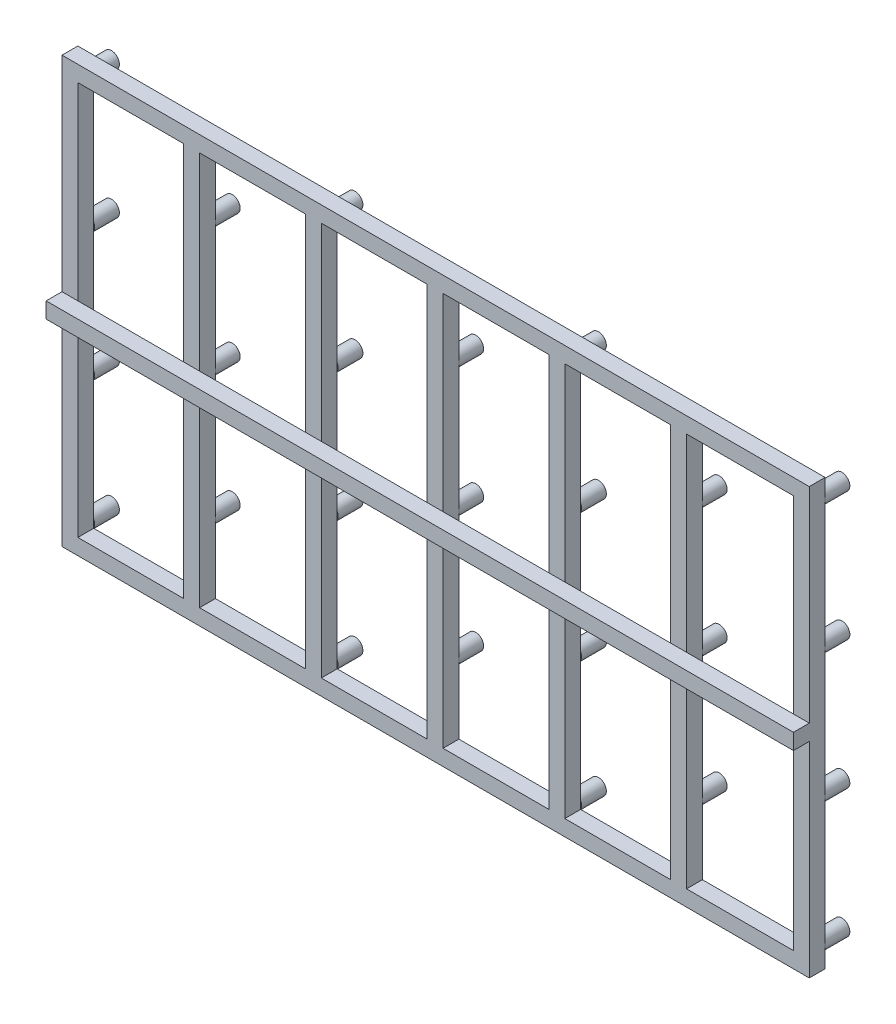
ISO-10303-21;
HEADER;
FILE_DESCRIPTION(('STEP AP214'),'2;1');
FILE_NAME('part.step','',(''),(''),'','','');
FILE_SCHEMA(('AUTOMOTIVE_DESIGN { 1 0 10303 214 1 1 1 1 }'));
ENDSEC;
DATA;
#1=APPLICATION_CONTEXT('core data for automotive mechanical design processes');
#2=APPLICATION_PROTOCOL_DEFINITION('international standard','automotive_design',2000,#1);
#3=PRODUCT_CONTEXT('',#1,'mechanical');
#4=PRODUCT('Part','Part','',(#3));
#5=PRODUCT_RELATED_PRODUCT_CATEGORY('part','',(#4));
#6=PRODUCT_DEFINITION_FORMATION('','',#4);
#7=PRODUCT_DEFINITION_CONTEXT('part definition',#1,'design');
#8=PRODUCT_DEFINITION('design','',#6,#7);
#9=PRODUCT_DEFINITION_SHAPE('','',#8);
#10=(LENGTH_UNIT() NAMED_UNIT(*) SI_UNIT(.MILLI.,.METRE.));
#11=(NAMED_UNIT(*) PLANE_ANGLE_UNIT() SI_UNIT($,.RADIAN.));
#12=(NAMED_UNIT(*) SI_UNIT($,.STERADIAN.) SOLID_ANGLE_UNIT());
#13=UNCERTAINTY_MEASURE_WITH_UNIT(LENGTH_MEASURE(1.E-05),#10,'distance_accuracy_value','');
#14=(GEOMETRIC_REPRESENTATION_CONTEXT(3) GLOBAL_UNCERTAINTY_ASSIGNED_CONTEXT((#13)) GLOBAL_UNIT_ASSIGNED_CONTEXT((#10,
#11,#12)) REPRESENTATION_CONTEXT('',''));
#15=CARTESIAN_POINT('',(0.,0.,0.));
#16=DIRECTION('',(0.,0.,1.));
#17=DIRECTION('',(1.,0.,0.));
#18=AXIS2_PLACEMENT_3D('',#15,#16,#17);
#19=CARTESIAN_POINT('',(1024.61263645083,506.979218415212,0.));
#20=DIRECTION('',(0.,0.,-1.));
#21=DIRECTION('',(-1.,0.,0.));
#22=AXIS2_PLACEMENT_3D('',#19,#20,#21);
#23=PLANE('',#22);
#24=DIRECTION('',(0.,1.,0.));
#25=VECTOR('',#24,1.);
#26=CARTESIAN_POINT('',(638.612636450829,92.9792184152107,0.));
#27=LINE('',#26,#25);
#28=CARTESIAN_POINT('',(638.612636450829,92.9792184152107,0.));
#29=VERTEX_POINT('',#28);
#30=CARTESIAN_POINT('',(638.61263645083,161.979218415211,0.));
#31=VERTEX_POINT('',#30);
#32=EDGE_CURVE('E792',#29,#31,#27,.T.);
#33=ORIENTED_EDGE('',*,*,#32,.T.);
#34=CARTESIAN_POINT('',(646.612636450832,161.979218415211,0.));
#35=DIRECTION('',(0.,0.,-1.));
#36=DIRECTION('',(-1.,0.,0.));
#37=AXIS2_PLACEMENT_3D('',#34,#35,#36);
#38=CIRCLE('',#37,7.99999999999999);
#39=CARTESIAN_POINT('',(654.61263645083,161.979218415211,0.));
#40=VERTEX_POINT('',#39);
#41=EDGE_CURVE('E982',#40,#31,#38,.T.);
#42=ORIENTED_EDGE('',*,*,#41,.F.);
#43=DIRECTION('',(0.,-1.,0.));
#44=VECTOR('',#43,1.);
#45=CARTESIAN_POINT('',(654.612636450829,92.9792184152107,0.));
#46=LINE('',#45,#44);
#47=CARTESIAN_POINT('',(654.612636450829,92.9792184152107,0.));
#48=VERTEX_POINT('',#47);
#49=EDGE_CURVE('E745',#40,#48,#46,.T.);
#50=ORIENTED_EDGE('',*,*,#49,.T.);
#51=DIRECTION('',(1.,0.,0.));
#52=VECTOR('',#51,1.);
#53=CARTESIAN_POINT('',(654.612636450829,92.9792184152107,0.));
#54=LINE('',#53,#52);
#55=CARTESIAN_POINT('',(761.612636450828,92.9792184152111,0.));
#56=VERTEX_POINT('',#55);
#57=EDGE_CURVE('E749',#48,#56,#54,.T.);
#58=ORIENTED_EDGE('',*,*,#57,.T.);
#59=DIRECTION('',(0.,1.,0.));
#60=VECTOR('',#59,1.);
#61=CARTESIAN_POINT('',(761.612636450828,92.9792184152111,0.));
#62=LINE('',#61,#60);
#63=CARTESIAN_POINT('',(761.612636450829,490.979218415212,0.));
#64=VERTEX_POINT('',#63);
#65=EDGE_CURVE('E753',#56,#64,#62,.T.);
#66=ORIENTED_EDGE('',*,*,#65,.T.);
#67=DIRECTION('',(-1.,0.,0.));
#68=VECTOR('',#67,1.);
#69=CARTESIAN_POINT('',(654.612636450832,490.979218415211,0.));
#70=LINE('',#69,#68);
#71=CARTESIAN_POINT('',(654.612636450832,490.979218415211,0.));
#72=VERTEX_POINT('',#71);
#73=EDGE_CURVE('E756',#64,#72,#70,.T.);
#74=ORIENTED_EDGE('',*,*,#73,.T.);
#75=CARTESIAN_POINT('',(654.612636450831,421.979218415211,0.));
#76=VERTEX_POINT('',#75);
#77=EDGE_CURVE('E746',#72,#76,#46,.T.);
#78=ORIENTED_EDGE('',*,*,#77,.T.);
#79=CARTESIAN_POINT('',(646.612636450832,421.979218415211,0.));
#80=DIRECTION('',(0.,0.,-1.));
#81=DIRECTION('',(-1.,0.,0.));
#82=AXIS2_PLACEMENT_3D('',#79,#80,#81);
#83=CIRCLE('',#82,7.99999999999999);
#84=CARTESIAN_POINT('',(638.612636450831,421.979218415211,0.));
#85=VERTEX_POINT('',#84);
#86=EDGE_CURVE('E995',#85,#76,#83,.T.);
#87=ORIENTED_EDGE('',*,*,#86,.F.);
#88=CARTESIAN_POINT('',(638.612636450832,490.979218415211,0.));
#89=VERTEX_POINT('',#88);
#90=EDGE_CURVE('E791',#85,#89,#27,.T.);
#91=ORIENTED_EDGE('',*,*,#90,.T.);
#92=DIRECTION('',(-1.,0.,0.));
#93=VECTOR('',#92,1.);
#94=CARTESIAN_POINT('',(531.612636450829,490.979218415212,0.));
#95=LINE('',#94,#93);
#96=CARTESIAN_POINT('',(531.612636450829,490.979218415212,0.));
#97=VERTEX_POINT('',#96);
#98=EDGE_CURVE('E795',#89,#97,#95,.T.);
#99=ORIENTED_EDGE('',*,*,#98,.T.);
#100=DIRECTION('',(0.,-1.,0.));
#101=VECTOR('',#100,1.);
#102=CARTESIAN_POINT('',(531.612636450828,92.9792184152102,0.));
#103=LINE('',#102,#101);
#104=CARTESIAN_POINT('',(531.612636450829,490.852201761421,0.));
#105=VERTEX_POINT('',#104);
#106=EDGE_CURVE('E784',#97,#105,#103,.T.);
#107=ORIENTED_EDGE('',*,*,#106,.T.);
#108=CARTESIAN_POINT('',(524.61263645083,486.979218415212,0.));
#109=DIRECTION('',(0.,0.,-1.));
#110=DIRECTION('',(-1.,0.,0.));
#111=AXIS2_PLACEMENT_3D('',#108,#109,#110);
#112=CIRCLE('',#111,7.99999999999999);
#113=CARTESIAN_POINT('',(531.612636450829,483.106235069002,0.));
#114=VERTEX_POINT('',#113);
#115=EDGE_CURVE('E1102',#114,#105,#112,.T.);
#116=ORIENTED_EDGE('',*,*,#115,.F.);
#117=CARTESIAN_POINT('',(531.612636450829,360.852201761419,0.));
#118=VERTEX_POINT('',#117);
#119=EDGE_CURVE('E2112',#114,#118,#103,.T.);
#120=ORIENTED_EDGE('',*,*,#119,.T.);
#121=CARTESIAN_POINT('',(524.612636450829,356.979218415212,0.));
#122=DIRECTION('',(0.,0.,-1.));
#123=DIRECTION('',(-1.,0.,0.));
#124=AXIS2_PLACEMENT_3D('',#121,#122,#123);
#125=CIRCLE('',#124,7.99999999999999);
#126=CARTESIAN_POINT('',(531.612636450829,353.106235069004,0.));
#127=VERTEX_POINT('',#126);
#128=EDGE_CURVE('E1074',#127,#118,#125,.T.);
#129=ORIENTED_EDGE('',*,*,#128,.F.);
#130=CARTESIAN_POINT('',(531.612636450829,230.852201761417,0.));
#131=VERTEX_POINT('',#130);
#132=EDGE_CURVE('E2105',#127,#131,#103,.T.);
#133=ORIENTED_EDGE('',*,*,#132,.T.);
#134=CARTESIAN_POINT('',(524.612636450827,226.979218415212,0.));
#135=DIRECTION('',(0.,0.,-1.));
#136=DIRECTION('',(-1.,0.,0.));
#137=AXIS2_PLACEMENT_3D('',#134,#135,#136);
#138=CIRCLE('',#137,7.99999999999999);
#139=CARTESIAN_POINT('',(531.612636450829,223.106235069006,0.));
#140=VERTEX_POINT('',#139);
#141=EDGE_CURVE('E1046',#140,#131,#138,.T.);
#142=ORIENTED_EDGE('',*,*,#141,.F.);
#143=CARTESIAN_POINT('',(531.612636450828,100.852201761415,0.));
#144=VERTEX_POINT('',#143);
#145=EDGE_CURVE('E2100',#140,#144,#103,.T.);
#146=ORIENTED_EDGE('',*,*,#145,.T.);
#147=CARTESIAN_POINT('',(524.612636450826,96.9792184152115,0.));
#148=DIRECTION('',(0.,0.,-1.));
#149=DIRECTION('',(-1.,0.,0.));
#150=AXIS2_PLACEMENT_3D('',#147,#148,#149);
#151=CIRCLE('',#150,7.99999999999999);
#152=CARTESIAN_POINT('',(531.612636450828,93.1062350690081,0.));
#153=VERTEX_POINT('',#152);
#154=EDGE_CURVE('E1019',#153,#144,#151,.T.);
#155=ORIENTED_EDGE('',*,*,#154,.F.);
#156=CARTESIAN_POINT('',(531.612636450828,92.9792184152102,0.));
#157=VERTEX_POINT('',#156);
#158=EDGE_CURVE('E783',#153,#157,#103,.T.);
#159=ORIENTED_EDGE('',*,*,#158,.T.);
#160=DIRECTION('',(1.,0.,0.));
#161=VECTOR('',#160,1.);
#162=CARTESIAN_POINT('',(531.612636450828,92.9792184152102,0.));
#163=LINE('',#162,#161);
#164=EDGE_CURVE('E787',#157,#29,#163,.T.);
#165=ORIENTED_EDGE('',*,*,#164,.T.);
#166=EDGE_LOOP('',(#33,#42,#50,#58,#66,#74,#78,#87,#91,#99,#107,#116,#120,#129,#133,#142,#146,
#155,#159,#165));
#167=FACE_BOUND('',#166,.T.);
#168=DIRECTION('',(0.,1.,0.));
#169=VECTOR('',#168,1.);
#170=CARTESIAN_POINT('',(884.612636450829,92.9792184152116,0.));
#171=LINE('',#170,#169);
#172=CARTESIAN_POINT('',(884.612636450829,92.9792184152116,0.));
#173=VERTEX_POINT('',#172);
#174=CARTESIAN_POINT('',(884.61263645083,161.979218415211,0.));
#175=VERTEX_POINT('',#174);
#176=EDGE_CURVE('E713',#173,#175,#171,.T.);
#177=ORIENTED_EDGE('',*,*,#176,.T.);
#178=CARTESIAN_POINT('',(892.612636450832,161.979218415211,0.));
#179=DIRECTION('',(0.,0.,-1.));
#180=DIRECTION('',(-1.,0.,0.));
#181=AXIS2_PLACEMENT_3D('',#178,#179,#180);
#182=CIRCLE('',#181,7.99999999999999);
#183=CARTESIAN_POINT('',(900.61263645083,161.979218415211,0.));
#184=VERTEX_POINT('',#183);
#185=EDGE_CURVE('E1000',#184,#175,#182,.T.);
#186=ORIENTED_EDGE('',*,*,#185,.F.);
#187=DIRECTION('',(0.,-1.,0.));
#188=VECTOR('',#187,1.);
#189=CARTESIAN_POINT('',(900.612636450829,92.9792184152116,0.));
#190=LINE('',#189,#188);
#191=CARTESIAN_POINT('',(900.612636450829,92.9792184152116,0.));
#192=VERTEX_POINT('',#191);
#193=EDGE_CURVE('E522',#184,#192,#190,.T.);
#194=ORIENTED_EDGE('',*,*,#193,.T.);
#195=DIRECTION('',(1.,0.,0.));
#196=VECTOR('',#195,1.);
#197=CARTESIAN_POINT('',(900.612636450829,92.9792184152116,0.));
#198=LINE('',#197,#196);
#199=CARTESIAN_POINT('',(1008.61263645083,92.9792184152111,0.));
#200=VERTEX_POINT('',#199);
#201=EDGE_CURVE('E526',#192,#200,#198,.T.);
#202=ORIENTED_EDGE('',*,*,#201,.T.);
#203=DIRECTION('',(0.,1.,0.));
#204=VECTOR('',#203,1.);
#205=CARTESIAN_POINT('',(1008.61263645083,92.9792184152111,0.));
#206=LINE('',#205,#204);
#207=CARTESIAN_POINT('',(1008.61263645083,96.9792184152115,0.));
#208=VERTEX_POINT('',#207);
#209=EDGE_CURVE('E531',#200,#208,#206,.T.);
#210=ORIENTED_EDGE('',*,*,#209,.T.);
#211=CARTESIAN_POINT('',(1016.61263645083,96.9792184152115,0.));
#212=DIRECTION('',(0.,0.,-1.));
#213=DIRECTION('',(-1.,0.,0.));
#214=AXIS2_PLACEMENT_3D('',#211,#212,#213);
#215=CIRCLE('',#214,7.99999999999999);
#216=CARTESIAN_POINT('',(1024.61263645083,96.9792184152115,0.));
#217=VERTEX_POINT('',#216);
#218=EDGE_CURVE('E1033',#217,#208,#215,.T.);
#219=ORIENTED_EDGE('',*,*,#218,.F.);
#220=DIRECTION('',(0.,1.,0.));
#221=VECTOR('',#220,1.);
#222=CARTESIAN_POINT('',(1024.61263645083,506.979218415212,0.));
#223=LINE('',#222,#221);
#224=CARTESIAN_POINT('',(1024.61263645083,76.9792184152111,0.));
#225=VERTEX_POINT('',#224);
#226=EDGE_CURVE('E606',#225,#217,#223,.T.);
#227=ORIENTED_EDGE('',*,*,#226,.F.);
#228=DIRECTION('',(1.,0.,0.));
#229=VECTOR('',#228,1.);
#230=CARTESIAN_POINT('',(269.61263645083,76.9792184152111,0.));
#231=LINE('',#230,#229);
#232=CARTESIAN_POINT('',(269.61263645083,76.9792184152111,0.));
#233=VERTEX_POINT('',#232);
#234=EDGE_CURVE('E603',#233,#225,#231,.T.);
#235=ORIENTED_EDGE('',*,*,#234,.F.);
#236=DIRECTION('',(0.,-1.,0.));
#237=VECTOR('',#236,1.);
#238=CARTESIAN_POINT('',(269.612636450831,506.979218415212,0.));
#239=LINE('',#238,#237);
#240=CARTESIAN_POINT('',(269.612636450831,506.979218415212,0.));
#241=VERTEX_POINT('',#240);
#242=EDGE_CURVE('E601',#241,#233,#239,.T.);
#243=ORIENTED_EDGE('',*,*,#242,.F.);
#244=DIRECTION('',(-1.,0.,0.));
#245=VECTOR('',#244,1.);
#246=CARTESIAN_POINT('',(269.612636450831,506.979218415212,0.));
#247=LINE('',#246,#245);
#248=CARTESIAN_POINT('',(1024.61263645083,506.979218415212,0.));
#249=VERTEX_POINT('',#248);
#250=EDGE_CURVE('E598',#249,#241,#247,.T.);
#251=ORIENTED_EDGE('',*,*,#250,.F.);
#252=CARTESIAN_POINT('',(1024.61263645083,486.979218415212,0.));
#253=VERTEX_POINT('',#252);
#254=EDGE_CURVE('E605',#253,#249,#223,.T.);
#255=ORIENTED_EDGE('',*,*,#254,.F.);
#256=CARTESIAN_POINT('',(1016.61263645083,486.979218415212,0.));
#257=DIRECTION('',(0.,0.,-1.));
#258=DIRECTION('',(-1.,0.,0.));
#259=AXIS2_PLACEMENT_3D('',#256,#257,#258);
#260=CIRCLE('',#259,7.99999999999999);
#261=CARTESIAN_POINT('',(1008.61263645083,486.979218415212,0.));
#262=VERTEX_POINT('',#261);
#263=EDGE_CURVE('E35',#262,#253,#260,.T.);
#264=ORIENTED_EDGE('',*,*,#263,.F.);
#265=CARTESIAN_POINT('',(1008.61263645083,490.979218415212,0.));
#266=VERTEX_POINT('',#265);
#267=EDGE_CURVE('E530',#262,#266,#206,.T.);
#268=ORIENTED_EDGE('',*,*,#267,.T.);
#269=DIRECTION('',(-1.,0.,0.));
#270=VECTOR('',#269,1.);
#271=CARTESIAN_POINT('',(900.612636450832,490.979218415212,0.));
#272=LINE('',#271,#270);
#273=CARTESIAN_POINT('',(900.612636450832,490.979218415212,0.));
#274=VERTEX_POINT('',#273);
#275=EDGE_CURVE('E519',#266,#274,#272,.T.);
#276=ORIENTED_EDGE('',*,*,#275,.T.);
#277=CARTESIAN_POINT('',(900.612636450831,421.979218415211,0.));
#278=VERTEX_POINT('',#277);
#279=EDGE_CURVE('E523',#274,#278,#190,.T.);
#280=ORIENTED_EDGE('',*,*,#279,.T.);
#281=CARTESIAN_POINT('',(892.612636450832,421.979218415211,0.));
#282=DIRECTION('',(0.,0.,-1.));
#283=DIRECTION('',(-1.,0.,0.));
#284=AXIS2_PLACEMENT_3D('',#281,#282,#283);
#285=CIRCLE('',#284,7.99999999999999);
#286=CARTESIAN_POINT('',(884.612636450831,421.979218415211,0.));
#287=VERTEX_POINT('',#286);
#288=EDGE_CURVE('E1117',#287,#278,#285,.T.);
#289=ORIENTED_EDGE('',*,*,#288,.F.);
#290=CARTESIAN_POINT('',(884.612636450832,490.979218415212,0.));
#291=VERTEX_POINT('',#290);
#292=EDGE_CURVE('E712',#287,#291,#171,.T.);
#293=ORIENTED_EDGE('',*,*,#292,.T.);
#294=DIRECTION('',(-1.,0.,0.));
#295=VECTOR('',#294,1.);
#296=CARTESIAN_POINT('',(777.612636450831,490.979218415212,0.));
#297=LINE('',#296,#295);
#298=CARTESIAN_POINT('',(777.612636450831,490.979218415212,0.));
#299=VERTEX_POINT('',#298);
#300=EDGE_CURVE('E716',#291,#299,#297,.T.);
#301=ORIENTED_EDGE('',*,*,#300,.T.);
#302=DIRECTION('',(0.,-1.,0.));
#303=VECTOR('',#302,1.);
#304=CARTESIAN_POINT('',(777.612636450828,92.9792184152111,0.));
#305=LINE('',#304,#303);
#306=CARTESIAN_POINT('',(777.612636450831,490.852201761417,0.));
#307=VERTEX_POINT('',#306);
#308=EDGE_CURVE('E705',#299,#307,#305,.T.);
#309=ORIENTED_EDGE('',*,*,#308,.T.);
#310=CARTESIAN_POINT('',(770.61263645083,486.979218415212,0.));
#311=DIRECTION('',(0.,0.,-1.));
#312=DIRECTION('',(-1.,0.,0.));
#313=AXIS2_PLACEMENT_3D('',#310,#311,#312);
#314=CIRCLE('',#313,7.99999999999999);
#315=CARTESIAN_POINT('',(777.612636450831,483.106235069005,0.));
#316=VERTEX_POINT('',#315);
#317=EDGE_CURVE('E1109',#316,#307,#314,.T.);
#318=ORIENTED_EDGE('',*,*,#317,.F.);
#319=CARTESIAN_POINT('',(777.61263645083,360.852201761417,0.));
#320=VERTEX_POINT('',#319);
#321=EDGE_CURVE('E1303',#316,#320,#305,.T.);
#322=ORIENTED_EDGE('',*,*,#321,.T.);
#323=CARTESIAN_POINT('',(770.612636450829,356.979218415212,0.));
#324=DIRECTION('',(0.,0.,-1.));
#325=DIRECTION('',(-1.,0.,0.));
#326=AXIS2_PLACEMENT_3D('',#323,#324,#325);
#327=CIRCLE('',#326,7.99999999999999);
#328=CARTESIAN_POINT('',(777.61263645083,353.106235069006,0.));
#329=VERTEX_POINT('',#328);
#330=EDGE_CURVE('E1081',#329,#320,#327,.T.);
#331=ORIENTED_EDGE('',*,*,#330,.F.);
#332=CARTESIAN_POINT('',(777.612636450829,230.852201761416,0.));
#333=VERTEX_POINT('',#332);
#334=EDGE_CURVE('E1308',#329,#333,#305,.T.);
#335=ORIENTED_EDGE('',*,*,#334,.T.);
#336=CARTESIAN_POINT('',(770.612636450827,226.979218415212,0.));
#337=DIRECTION('',(0.,0.,-1.));
#338=DIRECTION('',(-1.,0.,0.));
#339=AXIS2_PLACEMENT_3D('',#336,#337,#338);
#340=CIRCLE('',#339,7.99999999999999);
#341=CARTESIAN_POINT('',(777.612636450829,223.106235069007,0.));
#342=VERTEX_POINT('',#341);
#343=EDGE_CURVE('E1053',#342,#333,#340,.T.);
#344=ORIENTED_EDGE('',*,*,#343,.F.);
#345=CARTESIAN_POINT('',(777.612636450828,100.852201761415,0.));
#346=VERTEX_POINT('',#345);
#347=EDGE_CURVE('E1316',#342,#346,#305,.T.);
#348=ORIENTED_EDGE('',*,*,#347,.T.);
#349=CARTESIAN_POINT('',(770.612636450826,96.9792184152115,0.));
#350=DIRECTION('',(0.,0.,-1.));
#351=DIRECTION('',(-1.,0.,0.));
#352=AXIS2_PLACEMENT_3D('',#349,#350,#351);
#353=CIRCLE('',#352,7.99999999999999);
#354=CARTESIAN_POINT('',(777.612636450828,93.1062350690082,0.));
#355=VERTEX_POINT('',#354);
#356=EDGE_CURVE('E1026',#355,#346,#353,.T.);
#357=ORIENTED_EDGE('',*,*,#356,.F.);
#358=CARTESIAN_POINT('',(777.612636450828,92.9792184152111,0.));
#359=VERTEX_POINT('',#358);
#360=EDGE_CURVE('E670',#355,#359,#305,.T.);
#361=ORIENTED_EDGE('',*,*,#360,.T.);
#362=DIRECTION('',(1.,0.,0.));
#363=VECTOR('',#362,1.);
#364=CARTESIAN_POINT('',(777.612636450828,92.9792184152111,0.));
#365=LINE('',#364,#363);
#366=EDGE_CURVE('E708',#359,#173,#365,.T.);
#367=ORIENTED_EDGE('',*,*,#366,.T.);
#368=EDGE_LOOP('',(#177,#186,#194,#202,#210,#219,#227,#235,#243,#251,#255,#264,#268,#276,#280,
#289,#293,#301,#309,#318,#322,#331,#335,#344,#348,#357,#361,#367));
#369=FACE_BOUND('',#368,.T.);
#370=DIRECTION('',(0.,1.,0.));
#371=VECTOR('',#370,1.);
#372=CARTESIAN_POINT('',(392.612636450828,92.9792184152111,0.));
#373=LINE('',#372,#371);
#374=CARTESIAN_POINT('',(392.612636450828,92.9792184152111,0.));
#375=VERTEX_POINT('',#374);
#376=CARTESIAN_POINT('',(392.612636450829,161.979218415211,0.));
#377=VERTEX_POINT('',#376);
#378=EDGE_CURVE('E469',#375,#377,#373,.T.);
#379=ORIENTED_EDGE('',*,*,#378,.T.);
#380=CARTESIAN_POINT('',(400.612636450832,161.979218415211,0.));
#381=DIRECTION('',(0.,0.,-1.));
#382=DIRECTION('',(-1.,0.,0.));
#383=AXIS2_PLACEMENT_3D('',#380,#381,#382);
#384=CIRCLE('',#383,7.99999999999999);
#385=CARTESIAN_POINT('',(408.612636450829,161.979218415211,0.));
#386=VERTEX_POINT('',#385);
#387=EDGE_CURVE('E41',#386,#377,#384,.T.);
#388=ORIENTED_EDGE('',*,*,#387,.F.);
#389=DIRECTION('',(0.,-1.,0.));
#390=VECTOR('',#389,1.);
#391=CARTESIAN_POINT('',(408.612636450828,92.9792184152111,0.));
#392=LINE('',#391,#390);
#393=CARTESIAN_POINT('',(408.612636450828,92.9792184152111,0.));
#394=VERTEX_POINT('',#393);
#395=EDGE_CURVE('E465',#386,#394,#392,.T.);
#396=ORIENTED_EDGE('',*,*,#395,.T.);
#397=DIRECTION('',(1.,0.,0.));
#398=VECTOR('',#397,1.);
#399=CARTESIAN_POINT('',(408.612636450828,92.9792184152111,0.));
#400=LINE('',#399,#398);
#401=CARTESIAN_POINT('',(515.612636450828,92.9792184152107,0.));
#402=VERTEX_POINT('',#401);
#403=EDGE_CURVE('E488',#394,#402,#400,.T.);
#404=ORIENTED_EDGE('',*,*,#403,.T.);
#405=DIRECTION('',(0.,1.,0.));
#406=VECTOR('',#405,1.);
#407=CARTESIAN_POINT('',(515.612636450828,92.9792184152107,0.));
#408=LINE('',#407,#406);
#409=CARTESIAN_POINT('',(515.612636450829,490.979218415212,0.));
#410=VERTEX_POINT('',#409);
#411=EDGE_CURVE('E491',#402,#410,#408,.T.);
#412=ORIENTED_EDGE('',*,*,#411,.T.);
#413=DIRECTION('',(-1.,0.,0.));
#414=VECTOR('',#413,1.);
#415=CARTESIAN_POINT('',(408.612636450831,490.979218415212,0.));
#416=LINE('',#415,#414);
#417=CARTESIAN_POINT('',(408.612636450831,490.979218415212,0.));
#418=VERTEX_POINT('',#417);
#419=EDGE_CURVE('E494',#410,#418,#416,.T.);
#420=ORIENTED_EDGE('',*,*,#419,.T.);
#421=CARTESIAN_POINT('',(408.61263645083,421.979218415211,0.));
#422=VERTEX_POINT('',#421);
#423=EDGE_CURVE('E481',#418,#422,#392,.T.);
#424=ORIENTED_EDGE('',*,*,#423,.T.);
#425=CARTESIAN_POINT('',(400.612636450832,421.979218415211,0.));
#426=DIRECTION('',(0.,0.,-1.));
#427=DIRECTION('',(-1.,0.,0.));
#428=AXIS2_PLACEMENT_3D('',#425,#426,#427);
#429=CIRCLE('',#428,7.99999999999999);
#430=CARTESIAN_POINT('',(392.61263645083,421.979218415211,0.));
#431=VERTEX_POINT('',#430);
#432=EDGE_CURVE('E961',#431,#422,#429,.T.);
#433=ORIENTED_EDGE('',*,*,#432,.F.);
#434=CARTESIAN_POINT('',(392.612636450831,490.979218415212,0.));
#435=VERTEX_POINT('',#434);
#436=EDGE_CURVE('E568',#431,#435,#373,.T.);
#437=ORIENTED_EDGE('',*,*,#436,.T.);
#438=DIRECTION('',(-1.,0.,0.));
#439=VECTOR('',#438,1.);
#440=CARTESIAN_POINT('',(285.612636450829,490.979218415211,0.));
#441=LINE('',#440,#439);
#442=CARTESIAN_POINT('',(285.612636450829,490.979218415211,0.));
#443=VERTEX_POINT('',#442);
#444=EDGE_CURVE('E570',#435,#443,#441,.T.);
#445=ORIENTED_EDGE('',*,*,#444,.T.);
#446=DIRECTION('',(0.,-1.,0.));
#447=VECTOR('',#446,1.);
#448=CARTESIAN_POINT('',(285.61263645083,92.9792184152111,0.));
#449=LINE('',#448,#447);
#450=CARTESIAN_POINT('',(285.612636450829,490.852201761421,0.));
#451=VERTEX_POINT('',#450);
#452=EDGE_CURVE('E562',#443,#451,#449,.T.);
#453=ORIENTED_EDGE('',*,*,#452,.T.);
#454=CARTESIAN_POINT('',(278.61263645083,486.979218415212,0.));
#455=DIRECTION('',(0.,0.,-1.));
#456=DIRECTION('',(-1.,0.,0.));
#457=AXIS2_PLACEMENT_3D('',#454,#455,#456);
#458=CIRCLE('',#457,7.99999999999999);
#459=CARTESIAN_POINT('',(285.612636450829,483.106235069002,0.));
#460=VERTEX_POINT('',#459);
#461=EDGE_CURVE('E1095',#460,#451,#458,.T.);
#462=ORIENTED_EDGE('',*,*,#461,.F.);
#463=CARTESIAN_POINT('',(285.612636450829,360.852201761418,0.));
#464=VERTEX_POINT('',#463);
#465=EDGE_CURVE('E2132',#460,#464,#449,.T.);
#466=ORIENTED_EDGE('',*,*,#465,.T.);
#467=CARTESIAN_POINT('',(278.612636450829,356.979218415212,0.));
#468=DIRECTION('',(0.,0.,-1.));
#469=DIRECTION('',(-1.,0.,0.));
#470=AXIS2_PLACEMENT_3D('',#467,#468,#469);
#471=CIRCLE('',#470,7.99999999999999);
#472=CARTESIAN_POINT('',(285.612636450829,353.106235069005,0.));
#473=VERTEX_POINT('',#472);
#474=EDGE_CURVE('E1067',#473,#464,#471,.T.);
#475=ORIENTED_EDGE('',*,*,#474,.F.);
#476=CARTESIAN_POINT('',(285.61263645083,230.852201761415,0.));
#477=VERTEX_POINT('',#476);
#478=EDGE_CURVE('E2138',#473,#477,#449,.T.);
#479=ORIENTED_EDGE('',*,*,#478,.T.);
#480=CARTESIAN_POINT('',(278.612636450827,226.979218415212,0.));
#481=DIRECTION('',(0.,0.,-1.));
#482=DIRECTION('',(-1.,0.,0.));
#483=AXIS2_PLACEMENT_3D('',#480,#481,#482);
#484=CIRCLE('',#483,7.99999999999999);
#485=CARTESIAN_POINT('',(285.61263645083,223.106235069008,0.));
#486=VERTEX_POINT('',#485);
#487=EDGE_CURVE('E1039',#486,#477,#484,.T.);
#488=ORIENTED_EDGE('',*,*,#487,.F.);
#489=CARTESIAN_POINT('',(285.61263645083,100.852201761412,0.));
#490=VERTEX_POINT('',#489);
#491=EDGE_CURVE('E2145',#486,#490,#449,.T.);
#492=ORIENTED_EDGE('',*,*,#491,.T.);
#493=CARTESIAN_POINT('',(278.612636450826,96.9792184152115,0.));
#494=DIRECTION('',(0.,0.,-1.));
#495=DIRECTION('',(-1.,0.,0.));
#496=AXIS2_PLACEMENT_3D('',#493,#494,#495);
#497=CIRCLE('',#496,7.99999999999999);
#498=CARTESIAN_POINT('',(285.61263645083,93.1062350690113,0.));
#499=VERTEX_POINT('',#498);
#500=EDGE_CURVE('E1012',#499,#490,#497,.T.);
#501=ORIENTED_EDGE('',*,*,#500,.F.);
#502=CARTESIAN_POINT('',(285.61263645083,92.9792184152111,0.));
#503=VERTEX_POINT('',#502);
#504=EDGE_CURVE('E561',#499,#503,#449,.T.);
#505=ORIENTED_EDGE('',*,*,#504,.T.);
#506=DIRECTION('',(1.,0.,0.));
#507=VECTOR('',#506,1.);
#508=CARTESIAN_POINT('',(285.61263645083,92.9792184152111,0.));
#509=LINE('',#508,#507);
#510=EDGE_CURVE('E565',#503,#375,#509,.T.);
#511=ORIENTED_EDGE('',*,*,#510,.T.);
#512=EDGE_LOOP('',(#379,#388,#396,#404,#412,#420,#424,#433,#437,#445,#453,#462,#466,#475,#479,
#488,#492,#501,#505,#511));
#513=FACE_BOUND('',#512,.T.);
#514=ADVANCED_FACE('F24',(#167,#369,#513),#23,.T.);
#515=CARTESIAN_POINT('',(408.61263645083,291.979218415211,0.));
#516=VERTEX_POINT('',#515);
#517=EDGE_CURVE('E475',#516,#386,#392,.T.);
#518=ORIENTED_EDGE('',*,*,#517,.T.);
#519=EDGE_CURVE('E456',#377,#386,#384,.T.);
#520=ORIENTED_EDGE('',*,*,#519,.F.);
#521=CARTESIAN_POINT('',(392.612636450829,291.979218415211,0.));
#522=VERTEX_POINT('',#521);
#523=EDGE_CURVE('E48',#377,#522,#373,.T.);
#524=ORIENTED_EDGE('',*,*,#523,.T.);
#525=CARTESIAN_POINT('',(400.612636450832,291.979218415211,0.));
#526=DIRECTION('',(0.,0.,-1.));
#527=DIRECTION('',(-1.,0.,0.));
#528=AXIS2_PLACEMENT_3D('',#525,#526,#527);
#529=CIRCLE('',#528,7.99999999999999);
#530=EDGE_CURVE('E483',#516,#522,#529,.T.);
#531=ORIENTED_EDGE('',*,*,#530,.F.);
#532=EDGE_LOOP('',(#518,#520,#524,#531));
#533=FACE_BOUND('',#532,.T.);
#534=ADVANCED_FACE('F482',(#533),#23,.T.);
#535=EDGE_CURVE('E484',#422,#516,#392,.T.);
#536=ORIENTED_EDGE('',*,*,#535,.T.);
#537=EDGE_CURVE('E970',#522,#516,#529,.T.);
#538=ORIENTED_EDGE('',*,*,#537,.F.);
#539=EDGE_CURVE('E963',#522,#431,#373,.T.);
#540=ORIENTED_EDGE('',*,*,#539,.T.);
#541=EDGE_CURVE('E969',#422,#431,#429,.T.);
#542=ORIENTED_EDGE('',*,*,#541,.F.);
#543=EDGE_LOOP('',(#536,#538,#540,#542));
#544=FACE_BOUND('',#543,.T.);
#545=ADVANCED_FACE('F968',(#544),#23,.T.);
#546=CARTESIAN_POINT('',(654.61263645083,291.979218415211,0.));
#547=VERTEX_POINT('',#546);
#548=EDGE_CURVE('E1247',#547,#40,#46,.T.);
#549=ORIENTED_EDGE('',*,*,#548,.T.);
#550=EDGE_CURVE('E983',#31,#40,#38,.T.);
#551=ORIENTED_EDGE('',*,*,#550,.F.);
#552=CARTESIAN_POINT('',(638.612636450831,291.979218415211,0.));
#553=VERTEX_POINT('',#552);
#554=EDGE_CURVE('E796',#31,#553,#27,.T.);
#555=ORIENTED_EDGE('',*,*,#554,.T.);
#556=CARTESIAN_POINT('',(646.612636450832,291.979218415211,0.));
#557=DIRECTION('',(0.,0.,-1.));
#558=DIRECTION('',(-1.,0.,0.));
#559=AXIS2_PLACEMENT_3D('',#556,#557,#558);
#560=CIRCLE('',#559,7.99999999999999);
#561=EDGE_CURVE('E988',#547,#553,#560,.T.);
#562=ORIENTED_EDGE('',*,*,#561,.F.);
#563=EDGE_LOOP('',(#549,#551,#555,#562));
#564=FACE_BOUND('',#563,.T.);
#565=ADVANCED_FACE('F1233',(#564),#23,.T.);
#566=EDGE_CURVE('E750',#76,#547,#46,.T.);
#567=ORIENTED_EDGE('',*,*,#566,.T.);
#568=EDGE_CURVE('E989',#553,#547,#560,.T.);
#569=ORIENTED_EDGE('',*,*,#568,.F.);
#570=EDGE_CURVE('E2092',#553,#85,#27,.T.);
#571=ORIENTED_EDGE('',*,*,#570,.T.);
#572=EDGE_CURVE('E994',#76,#85,#83,.T.);
#573=ORIENTED_EDGE('',*,*,#572,.F.);
#574=EDGE_LOOP('',(#567,#569,#571,#573));
#575=FACE_BOUND('',#574,.T.);
#576=ADVANCED_FACE('F1229',(#575),#23,.T.);
#577=CARTESIAN_POINT('',(900.61263645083,291.979218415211,0.));
#578=VERTEX_POINT('',#577);
#579=EDGE_CURVE('E1164',#578,#184,#190,.T.);
#580=ORIENTED_EDGE('',*,*,#579,.T.);
#581=EDGE_CURVE('E1001',#175,#184,#182,.T.);
#582=ORIENTED_EDGE('',*,*,#581,.F.);
#583=CARTESIAN_POINT('',(884.61263645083,291.979218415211,0.));
#584=VERTEX_POINT('',#583);
#585=EDGE_CURVE('E717',#175,#584,#171,.T.);
#586=ORIENTED_EDGE('',*,*,#585,.T.);
#587=CARTESIAN_POINT('',(892.612636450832,291.979218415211,0.));
#588=DIRECTION('',(0.,0.,-1.));
#589=DIRECTION('',(-1.,0.,0.));
#590=AXIS2_PLACEMENT_3D('',#587,#588,#589);
#591=CIRCLE('',#590,7.99999999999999);
#592=EDGE_CURVE('E1006',#578,#584,#591,.T.);
#593=ORIENTED_EDGE('',*,*,#592,.F.);
#594=EDGE_LOOP('',(#580,#582,#586,#593));
#595=FACE_BOUND('',#594,.T.);
#596=ADVANCED_FACE('F1169',(#595),#23,.T.);
#597=EDGE_CURVE('E527',#278,#578,#190,.T.);
#598=ORIENTED_EDGE('',*,*,#597,.T.);
#599=EDGE_CURVE('E1007',#584,#578,#591,.T.);
#600=ORIENTED_EDGE('',*,*,#599,.F.);
#601=EDGE_CURVE('E1184',#584,#287,#171,.T.);
#602=ORIENTED_EDGE('',*,*,#601,.T.);
#603=EDGE_CURVE('E1116',#278,#287,#285,.T.);
#604=ORIENTED_EDGE('',*,*,#603,.F.);
#605=EDGE_LOOP('',(#598,#600,#602,#604));
#606=FACE_BOUND('',#605,.T.);
#607=ADVANCED_FACE('F1175',(#606),#23,.T.);
#608=CARTESIAN_POINT('',(1024.61263645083,226.979218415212,0.));
#609=VERTEX_POINT('',#608);
#610=EDGE_CURVE('E610',#217,#609,#223,.T.);
#611=ORIENTED_EDGE('',*,*,#610,.F.);
#612=EDGE_CURVE('E1034',#208,#217,#215,.T.);
#613=ORIENTED_EDGE('',*,*,#612,.F.);
#614=CARTESIAN_POINT('',(1008.61263645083,226.979218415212,0.));
#615=VERTEX_POINT('',#614);
#616=EDGE_CURVE('E535',#208,#615,#206,.T.);
#617=ORIENTED_EDGE('',*,*,#616,.T.);
#618=CARTESIAN_POINT('',(1016.61263645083,226.979218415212,0.));
#619=DIRECTION('',(0.,0.,-1.));
#620=DIRECTION('',(-1.,0.,0.));
#621=AXIS2_PLACEMENT_3D('',#618,#619,#620);
#622=CIRCLE('',#621,7.99999999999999);
#623=EDGE_CURVE('E1060',#609,#615,#622,.T.);
#624=ORIENTED_EDGE('',*,*,#623,.F.);
#625=EDGE_LOOP('',(#611,#613,#617,#624));
#626=FACE_BOUND('',#625,.T.);
#627=ADVANCED_FACE('F1141',(#626),#23,.T.);
#628=CARTESIAN_POINT('',(1024.61263645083,356.979218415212,0.));
#629=VERTEX_POINT('',#628);
#630=EDGE_CURVE('E1128',#609,#629,#223,.T.);
#631=ORIENTED_EDGE('',*,*,#630,.F.);
#632=EDGE_CURVE('E1061',#615,#609,#622,.T.);
#633=ORIENTED_EDGE('',*,*,#632,.F.);
#634=CARTESIAN_POINT('',(1008.61263645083,356.979218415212,0.));
#635=VERTEX_POINT('',#634);
#636=EDGE_CURVE('E1146',#615,#635,#206,.T.);
#637=ORIENTED_EDGE('',*,*,#636,.T.);
#638=CARTESIAN_POINT('',(1016.61263645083,356.979218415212,0.));
#639=DIRECTION('',(0.,0.,-1.));
#640=DIRECTION('',(-1.,0.,0.));
#641=AXIS2_PLACEMENT_3D('',#638,#639,#640);
#642=CIRCLE('',#641,7.99999999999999);
#643=EDGE_CURVE('E1088',#629,#635,#642,.T.);
#644=ORIENTED_EDGE('',*,*,#643,.F.);
#645=EDGE_LOOP('',(#631,#633,#637,#644));
#646=FACE_BOUND('',#645,.T.);
#647=ADVANCED_FACE('F1144',(#646),#23,.T.);
#648=EDGE_CURVE('E1127',#629,#253,#223,.T.);
#649=ORIENTED_EDGE('',*,*,#648,.F.);
#650=EDGE_CURVE('E1089',#635,#629,#642,.T.);
#651=ORIENTED_EDGE('',*,*,#650,.F.);
#652=EDGE_CURVE('E1152',#635,#262,#206,.T.);
#653=ORIENTED_EDGE('',*,*,#652,.T.);
#654=EDGE_CURVE('E11',#253,#262,#260,.T.);
#655=ORIENTED_EDGE('',*,*,#654,.F.);
#656=EDGE_LOOP('',(#649,#651,#653,#655));
#657=FACE_BOUND('',#656,.T.);
#658=ADVANCED_FACE('F1150',(#657),#23,.T.);
#659=CARTESIAN_POINT('',(1024.61263645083,506.979218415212,16.));
#660=DIRECTION('',(0.,0.,-1.));
#661=DIRECTION('',(-1.,0.,0.));
#662=AXIS2_PLACEMENT_3D('',#659,#660,#661);
#663=PLANE('',#662);
#664=DIRECTION('',(-1.,0.,0.));
#665=VECTOR('',#664,1.);
#666=CARTESIAN_POINT('',(269.612636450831,299.979218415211,16.));
#667=LINE('',#666,#665);
#668=CARTESIAN_POINT('',(1024.61263645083,299.979218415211,16.));
#669=VERTEX_POINT('',#668);
#670=CARTESIAN_POINT('',(1008.61263645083,299.979218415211,16.));
#671=VERTEX_POINT('',#670);
#672=EDGE_CURVE('E681',#669,#671,#667,.T.);
#673=ORIENTED_EDGE('',*,*,#672,.F.);
#674=DIRECTION('',(0.,1.,0.));
#675=VECTOR('',#674,1.);
#676=CARTESIAN_POINT('',(1024.61263645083,506.979218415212,16.));
#677=LINE('',#676,#675);
#678=CARTESIAN_POINT('',(1024.61263645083,506.979218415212,16.));
#679=VERTEX_POINT('',#678);
#680=EDGE_CURVE('E640',#669,#679,#677,.T.);
#681=ORIENTED_EDGE('',*,*,#680,.T.);
#682=DIRECTION('',(-1.,0.,0.));
#683=VECTOR('',#682,1.);
#684=CARTESIAN_POINT('',(269.612636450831,506.979218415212,16.));
#685=LINE('',#684,#683);
#686=CARTESIAN_POINT('',(269.612636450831,506.979218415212,16.));
#687=VERTEX_POINT('',#686);
#688=EDGE_CURVE('E609',#679,#687,#685,.T.);
#689=ORIENTED_EDGE('',*,*,#688,.T.);
#690=DIRECTION('',(0.,-1.,0.));
#691=VECTOR('',#690,1.);
#692=CARTESIAN_POINT('',(269.612636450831,506.979218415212,16.));
#693=LINE('',#692,#691);
#694=CARTESIAN_POINT('',(269.61263645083,299.979218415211,16.));
#695=VERTEX_POINT('',#694);
#696=EDGE_CURVE('E622',#687,#695,#693,.T.);
#697=ORIENTED_EDGE('',*,*,#696,.T.);
#698=CARTESIAN_POINT('',(285.61263645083,299.979218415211,16.));
#699=VERTEX_POINT('',#698);
#700=EDGE_CURVE('E677',#699,#695,#667,.T.);
#701=ORIENTED_EDGE('',*,*,#700,.F.);
#702=DIRECTION('',(0.,-1.,0.));
#703=VECTOR('',#702,1.);
#704=CARTESIAN_POINT('',(285.61263645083,92.9792184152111,16.));
#705=LINE('',#704,#703);
#706=CARTESIAN_POINT('',(285.612636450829,490.979218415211,16.));
#707=VERTEX_POINT('',#706);
#708=EDGE_CURVE('E574',#707,#699,#705,.T.);
#709=ORIENTED_EDGE('',*,*,#708,.F.);
#710=DIRECTION('',(-1.,0.,0.));
#711=VECTOR('',#710,1.);
#712=CARTESIAN_POINT('',(285.612636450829,490.979218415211,16.));
#713=LINE('',#712,#711);
#714=CARTESIAN_POINT('',(392.612636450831,490.979218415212,16.));
#715=VERTEX_POINT('',#714);
#716=EDGE_CURVE('E584',#715,#707,#713,.T.);
#717=ORIENTED_EDGE('',*,*,#716,.F.);
#718=DIRECTION('',(0.,1.,0.));
#719=VECTOR('',#718,1.);
#720=CARTESIAN_POINT('',(392.612636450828,92.9792184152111,16.));
#721=LINE('',#720,#719);
#722=CARTESIAN_POINT('',(392.61263645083,299.979218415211,16.));
#723=VERTEX_POINT('',#722);
#724=EDGE_CURVE('E580',#723,#715,#721,.T.);
#725=ORIENTED_EDGE('',*,*,#724,.F.);
#726=CARTESIAN_POINT('',(408.61263645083,299.979218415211,16.));
#727=VERTEX_POINT('',#726);
#728=EDGE_CURVE('E693',#727,#723,#667,.T.);
#729=ORIENTED_EDGE('',*,*,#728,.F.);
#730=DIRECTION('',(0.,-1.,0.));
#731=VECTOR('',#730,1.);
#732=CARTESIAN_POINT('',(408.612636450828,92.9792184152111,16.));
#733=LINE('',#732,#731);
#734=CARTESIAN_POINT('',(408.612636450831,490.979218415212,16.));
#735=VERTEX_POINT('',#734);
#736=EDGE_CURVE('E498',#735,#727,#733,.T.);
#737=ORIENTED_EDGE('',*,*,#736,.F.);
#738=DIRECTION('',(-1.,0.,0.));
#739=VECTOR('',#738,1.);
#740=CARTESIAN_POINT('',(408.612636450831,490.979218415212,16.));
#741=LINE('',#740,#739);
#742=CARTESIAN_POINT('',(515.612636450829,490.979218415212,16.));
#743=VERTEX_POINT('',#742);
#744=EDGE_CURVE('E508',#743,#735,#741,.T.);
#745=ORIENTED_EDGE('',*,*,#744,.F.);
#746=DIRECTION('',(0.,1.,0.));
#747=VECTOR('',#746,1.);
#748=CARTESIAN_POINT('',(515.612636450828,92.9792184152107,16.));
#749=LINE('',#748,#747);
#750=CARTESIAN_POINT('',(515.612636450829,299.979218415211,16.));
#751=VERTEX_POINT('',#750);
#752=EDGE_CURVE('E504',#751,#743,#749,.T.);
#753=ORIENTED_EDGE('',*,*,#752,.F.);
#754=CARTESIAN_POINT('',(531.612636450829,299.979218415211,16.));
#755=VERTEX_POINT('',#754);
#756=EDGE_CURVE('E904',#755,#751,#667,.T.);
#757=ORIENTED_EDGE('',*,*,#756,.F.);
#758=DIRECTION('',(0.,-1.,0.));
#759=VECTOR('',#758,1.);
#760=CARTESIAN_POINT('',(531.612636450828,92.9792184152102,16.));
#761=LINE('',#760,#759);
#762=CARTESIAN_POINT('',(531.612636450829,490.979218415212,16.));
#763=VERTEX_POINT('',#762);
#764=EDGE_CURVE('E800',#763,#755,#761,.T.);
#765=ORIENTED_EDGE('',*,*,#764,.F.);
#766=DIRECTION('',(-1.,0.,0.));
#767=VECTOR('',#766,1.);
#768=CARTESIAN_POINT('',(531.612636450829,490.979218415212,16.));
#769=LINE('',#768,#767);
#770=CARTESIAN_POINT('',(638.612636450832,490.979218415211,16.));
#771=VERTEX_POINT('',#770);
#772=EDGE_CURVE('E810',#771,#763,#769,.T.);
#773=ORIENTED_EDGE('',*,*,#772,.F.);
#774=DIRECTION('',(0.,1.,0.));
#775=VECTOR('',#774,1.);
#776=CARTESIAN_POINT('',(638.612636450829,92.9792184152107,16.));
#777=LINE('',#776,#775);
#778=CARTESIAN_POINT('',(638.612636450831,299.979218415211,16.));
#779=VERTEX_POINT('',#778);
#780=EDGE_CURVE('E806',#779,#771,#777,.T.);
#781=ORIENTED_EDGE('',*,*,#780,.F.);
#782=CARTESIAN_POINT('',(654.61263645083,299.979218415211,16.));
#783=VERTEX_POINT('',#782);
#784=EDGE_CURVE('E902',#783,#779,#667,.T.);
#785=ORIENTED_EDGE('',*,*,#784,.F.);
#786=DIRECTION('',(0.,-1.,0.));
#787=VECTOR('',#786,1.);
#788=CARTESIAN_POINT('',(654.612636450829,92.9792184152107,16.));
#789=LINE('',#788,#787);
#790=CARTESIAN_POINT('',(654.612636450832,490.979218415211,16.));
#791=VERTEX_POINT('',#790);
#792=EDGE_CURVE('E760',#791,#783,#789,.T.);
#793=ORIENTED_EDGE('',*,*,#792,.F.);
#794=DIRECTION('',(-1.,0.,0.));
#795=VECTOR('',#794,1.);
#796=CARTESIAN_POINT('',(654.612636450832,490.979218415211,16.));
#797=LINE('',#796,#795);
#798=CARTESIAN_POINT('',(761.612636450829,490.979218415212,16.));
#799=VERTEX_POINT('',#798);
#800=EDGE_CURVE('E770',#799,#791,#797,.T.);
#801=ORIENTED_EDGE('',*,*,#800,.F.);
#802=DIRECTION('',(0.,1.,0.));
#803=VECTOR('',#802,1.);
#804=CARTESIAN_POINT('',(761.612636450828,92.9792184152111,16.));
#805=LINE('',#804,#803);
#806=CARTESIAN_POINT('',(761.612636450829,299.979218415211,16.));
#807=VERTEX_POINT('',#806);
#808=EDGE_CURVE('E766',#807,#799,#805,.T.);
#809=ORIENTED_EDGE('',*,*,#808,.F.);
#810=CARTESIAN_POINT('',(777.61263645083,299.979218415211,16.));
#811=VERTEX_POINT('',#810);
#812=EDGE_CURVE('E900',#811,#807,#667,.T.);
#813=ORIENTED_EDGE('',*,*,#812,.F.);
#814=DIRECTION('',(0.,-1.,0.));
#815=VECTOR('',#814,1.);
#816=CARTESIAN_POINT('',(777.612636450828,92.9792184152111,16.));
#817=LINE('',#816,#815);
#818=CARTESIAN_POINT('',(777.612636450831,490.979218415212,16.));
#819=VERTEX_POINT('',#818);
#820=EDGE_CURVE('E721',#819,#811,#817,.T.);
#821=ORIENTED_EDGE('',*,*,#820,.F.);
#822=DIRECTION('',(-1.,0.,0.));
#823=VECTOR('',#822,1.);
#824=CARTESIAN_POINT('',(777.612636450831,490.979218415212,16.));
#825=LINE('',#824,#823);
#826=CARTESIAN_POINT('',(884.612636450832,490.979218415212,16.));
#827=VERTEX_POINT('',#826);
#828=EDGE_CURVE('E731',#827,#819,#825,.T.);
#829=ORIENTED_EDGE('',*,*,#828,.F.);
#830=DIRECTION('',(0.,1.,0.));
#831=VECTOR('',#830,1.);
#832=CARTESIAN_POINT('',(884.612636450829,92.9792184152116,16.));
#833=LINE('',#832,#831);
#834=CARTESIAN_POINT('',(884.612636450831,299.979218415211,16.));
#835=VERTEX_POINT('',#834);
#836=EDGE_CURVE('E727',#835,#827,#833,.T.);
#837=ORIENTED_EDGE('',*,*,#836,.F.);
#838=CARTESIAN_POINT('',(900.61263645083,299.979218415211,16.));
#839=VERTEX_POINT('',#838);
#840=EDGE_CURVE('E33',#839,#835,#667,.T.);
#841=ORIENTED_EDGE('',*,*,#840,.F.);
#842=DIRECTION('',(0.,-1.,0.));
#843=VECTOR('',#842,1.);
#844=CARTESIAN_POINT('',(900.612636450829,92.9792184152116,16.));
#845=LINE('',#844,#843);
#846=CARTESIAN_POINT('',(900.612636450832,490.979218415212,16.));
#847=VERTEX_POINT('',#846);
#848=EDGE_CURVE('E538',#847,#839,#845,.T.);
#849=ORIENTED_EDGE('',*,*,#848,.F.);
#850=DIRECTION('',(-1.,0.,0.));
#851=VECTOR('',#850,1.);
#852=CARTESIAN_POINT('',(900.612636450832,490.979218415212,16.));
#853=LINE('',#852,#851);
#854=CARTESIAN_POINT('',(1008.61263645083,490.979218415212,16.));
#855=VERTEX_POINT('',#854);
#856=EDGE_CURVE('E534',#855,#847,#853,.T.);
#857=ORIENTED_EDGE('',*,*,#856,.F.);
#858=DIRECTION('',(0.,1.,0.));
#859=VECTOR('',#858,1.);
#860=CARTESIAN_POINT('',(1008.61263645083,92.9792184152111,16.));
#861=LINE('',#860,#859);
#862=EDGE_CURVE('E545',#671,#855,#861,.T.);
#863=ORIENTED_EDGE('',*,*,#862,.F.);
#864=EDGE_LOOP('',(#673,#681,#689,#697,#701,#709,#717,#725,#729,#737,#745,#753,#757,#765,#773,
#781,#785,#793,#801,#809,#813,#821,#829,#837,#841,#849,#857,#863));
#865=FACE_BOUND('',#864,.T.);
#866=ADVANCED_FACE('F890',(#865),#663,.F.);
#867=DIRECTION('',(1.,0.,0.));
#868=VECTOR('',#867,1.);
#869=CARTESIAN_POINT('',(269.612636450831,283.979218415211,16.));
#870=LINE('',#869,#868);
#871=CARTESIAN_POINT('',(269.61263645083,283.979218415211,16.));
#872=VERTEX_POINT('',#871);
#873=CARTESIAN_POINT('',(285.61263645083,283.979218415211,16.));
#874=VERTEX_POINT('',#873);
#875=EDGE_CURVE('E692',#872,#874,#870,.T.);
#876=ORIENTED_EDGE('',*,*,#875,.F.);
#877=CARTESIAN_POINT('',(269.61263645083,76.9792184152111,16.));
#878=VERTEX_POINT('',#877);
#879=EDGE_CURVE('E613',#872,#878,#693,.T.);
#880=ORIENTED_EDGE('',*,*,#879,.T.);
#881=DIRECTION('',(1.,0.,0.));
#882=VECTOR('',#881,1.);
#883=CARTESIAN_POINT('',(269.61263645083,76.9792184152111,16.));
#884=LINE('',#883,#882);
#885=CARTESIAN_POINT('',(1024.61263645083,76.9792184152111,16.));
#886=VERTEX_POINT('',#885);
#887=EDGE_CURVE('E616',#878,#886,#884,.T.);
#888=ORIENTED_EDGE('',*,*,#887,.T.);
#889=CARTESIAN_POINT('',(1024.61263645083,283.979218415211,16.));
#890=VERTEX_POINT('',#889);
#891=EDGE_CURVE('E636',#886,#890,#677,.T.);
#892=ORIENTED_EDGE('',*,*,#891,.T.);
#893=CARTESIAN_POINT('',(1008.61263645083,283.979218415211,16.));
#894=VERTEX_POINT('',#893);
#895=EDGE_CURVE('E627',#894,#890,#870,.T.);
#896=ORIENTED_EDGE('',*,*,#895,.F.);
#897=CARTESIAN_POINT('',(1008.61263645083,92.9792184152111,16.));
#898=VERTEX_POINT('',#897);
#899=EDGE_CURVE('E546',#898,#894,#861,.T.);
#900=ORIENTED_EDGE('',*,*,#899,.F.);
#901=DIRECTION('',(1.,0.,0.));
#902=VECTOR('',#901,1.);
#903=CARTESIAN_POINT('',(900.612636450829,92.9792184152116,16.));
#904=LINE('',#903,#902);
#905=CARTESIAN_POINT('',(900.612636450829,92.9792184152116,16.));
#906=VERTEX_POINT('',#905);
#907=EDGE_CURVE('E541',#906,#898,#904,.T.);
#908=ORIENTED_EDGE('',*,*,#907,.F.);
#909=CARTESIAN_POINT('',(900.61263645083,283.979218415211,16.));
#910=VERTEX_POINT('',#909);
#911=EDGE_CURVE('E537',#910,#906,#845,.T.);
#912=ORIENTED_EDGE('',*,*,#911,.F.);
#913=CARTESIAN_POINT('',(884.61263645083,283.979218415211,16.));
#914=VERTEX_POINT('',#913);
#915=EDGE_CURVE('E866',#914,#910,#870,.T.);
#916=ORIENTED_EDGE('',*,*,#915,.F.);
#917=CARTESIAN_POINT('',(884.612636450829,92.9792184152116,16.));
#918=VERTEX_POINT('',#917);
#919=EDGE_CURVE('E728',#918,#914,#833,.T.);
#920=ORIENTED_EDGE('',*,*,#919,.F.);
#921=DIRECTION('',(1.,0.,0.));
#922=VECTOR('',#921,1.);
#923=CARTESIAN_POINT('',(777.612636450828,92.9792184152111,16.));
#924=LINE('',#923,#922);
#925=CARTESIAN_POINT('',(777.612636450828,92.9792184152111,16.));
#926=VERTEX_POINT('',#925);
#927=EDGE_CURVE('E724',#926,#918,#924,.T.);
#928=ORIENTED_EDGE('',*,*,#927,.F.);
#929=CARTESIAN_POINT('',(777.61263645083,283.979218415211,16.));
#930=VERTEX_POINT('',#929);
#931=EDGE_CURVE('E720',#930,#926,#817,.T.);
#932=ORIENTED_EDGE('',*,*,#931,.F.);
#933=CARTESIAN_POINT('',(761.612636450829,283.979218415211,16.));
#934=VERTEX_POINT('',#933);
#935=EDGE_CURVE('E869',#934,#930,#870,.T.);
#936=ORIENTED_EDGE('',*,*,#935,.F.);
#937=CARTESIAN_POINT('',(761.612636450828,92.9792184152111,16.));
#938=VERTEX_POINT('',#937);
#939=EDGE_CURVE('E767',#938,#934,#805,.T.);
#940=ORIENTED_EDGE('',*,*,#939,.F.);
#941=DIRECTION('',(1.,0.,0.));
#942=VECTOR('',#941,1.);
#943=CARTESIAN_POINT('',(654.612636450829,92.9792184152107,16.));
#944=LINE('',#943,#942);
#945=CARTESIAN_POINT('',(654.612636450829,92.9792184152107,16.));
#946=VERTEX_POINT('',#945);
#947=EDGE_CURVE('E763',#946,#938,#944,.T.);
#948=ORIENTED_EDGE('',*,*,#947,.F.);
#949=CARTESIAN_POINT('',(654.61263645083,283.979218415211,16.));
#950=VERTEX_POINT('',#949);
#951=EDGE_CURVE('E759',#950,#946,#789,.T.);
#952=ORIENTED_EDGE('',*,*,#951,.F.);
#953=CARTESIAN_POINT('',(638.61263645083,283.979218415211,16.));
#954=VERTEX_POINT('',#953);
#955=EDGE_CURVE('E835',#954,#950,#870,.T.);
#956=ORIENTED_EDGE('',*,*,#955,.F.);
#957=CARTESIAN_POINT('',(638.612636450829,92.9792184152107,16.));
#958=VERTEX_POINT('',#957);
#959=EDGE_CURVE('E807',#958,#954,#777,.T.);
#960=ORIENTED_EDGE('',*,*,#959,.F.);
#961=DIRECTION('',(1.,0.,0.));
#962=VECTOR('',#961,1.);
#963=CARTESIAN_POINT('',(531.612636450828,92.9792184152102,16.));
#964=LINE('',#963,#962);
#965=CARTESIAN_POINT('',(531.612636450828,92.9792184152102,16.));
#966=VERTEX_POINT('',#965);
#967=EDGE_CURVE('E803',#966,#958,#964,.T.);
#968=ORIENTED_EDGE('',*,*,#967,.F.);
#969=CARTESIAN_POINT('',(531.612636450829,283.979218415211,16.));
#970=VERTEX_POINT('',#969);
#971=EDGE_CURVE('E799',#970,#966,#761,.T.);
#972=ORIENTED_EDGE('',*,*,#971,.F.);
#973=CARTESIAN_POINT('',(515.612636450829,283.979218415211,16.));
#974=VERTEX_POINT('',#973);
#975=EDGE_CURVE('E854',#974,#970,#870,.T.);
#976=ORIENTED_EDGE('',*,*,#975,.F.);
#977=CARTESIAN_POINT('',(515.612636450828,92.9792184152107,16.));
#978=VERTEX_POINT('',#977);
#979=EDGE_CURVE('E505',#978,#974,#749,.T.);
#980=ORIENTED_EDGE('',*,*,#979,.F.);
#981=DIRECTION('',(1.,0.,0.));
#982=VECTOR('',#981,1.);
#983=CARTESIAN_POINT('',(408.612636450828,92.9792184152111,16.));
#984=LINE('',#983,#982);
#985=CARTESIAN_POINT('',(408.612636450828,92.9792184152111,16.));
#986=VERTEX_POINT('',#985);
#987=EDGE_CURVE('E501',#986,#978,#984,.T.);
#988=ORIENTED_EDGE('',*,*,#987,.F.);
#989=CARTESIAN_POINT('',(408.61263645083,283.979218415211,16.));
#990=VERTEX_POINT('',#989);
#991=EDGE_CURVE('E497',#990,#986,#733,.T.);
#992=ORIENTED_EDGE('',*,*,#991,.F.);
#993=CARTESIAN_POINT('',(392.612636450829,283.979218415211,16.));
#994=VERTEX_POINT('',#993);
#995=EDGE_CURVE('E909',#994,#990,#870,.T.);
#996=ORIENTED_EDGE('',*,*,#995,.F.);
#997=CARTESIAN_POINT('',(392.612636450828,92.9792184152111,16.));
#998=VERTEX_POINT('',#997);
#999=EDGE_CURVE('E581',#998,#994,#721,.T.);
#1000=ORIENTED_EDGE('',*,*,#999,.F.);
#1001=DIRECTION('',(1.,0.,0.));
#1002=VECTOR('',#1001,1.);
#1003=CARTESIAN_POINT('',(285.61263645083,92.9792184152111,16.));
#1004=LINE('',#1003,#1002);
#1005=CARTESIAN_POINT('',(285.61263645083,92.9792184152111,16.));
#1006=VERTEX_POINT('',#1005);
#1007=EDGE_CURVE('E577',#1006,#998,#1004,.T.);
#1008=ORIENTED_EDGE('',*,*,#1007,.F.);
#1009=EDGE_CURVE('E573',#874,#1006,#705,.T.);
#1010=ORIENTED_EDGE('',*,*,#1009,.F.);
#1011=EDGE_LOOP('',(#876,#880,#888,#892,#896,#900,#908,#912,#916,#920,#928,#932,#936,#940,#948,
#952,#956,#960,#968,#972,#976,#980,#988,#992,#996,#1000,#1008,#1010));
#1012=FACE_BOUND('',#1011,.T.);
#1013=ADVANCED_FACE('F650',(#1012),#663,.F.);
#1014=CARTESIAN_POINT('',(269.612636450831,506.979218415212,16.));
#1015=DIRECTION('',(0.,-1.,0.));
#1016=DIRECTION('',(0.,0.,-1.));
#1017=AXIS2_PLACEMENT_3D('',#1014,#1015,#1016);
#1018=PLANE('',#1017);
#1019=ORIENTED_EDGE('',*,*,#250,.T.);
#1020=DIRECTION('',(0.,0.,-1.));
#1021=VECTOR('',#1020,1.);
#1022=CARTESIAN_POINT('',(269.612636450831,506.979218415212,16.));
#1023=LINE('',#1022,#1021);
#1024=EDGE_CURVE('E624',#687,#241,#1023,.T.);
#1025=ORIENTED_EDGE('',*,*,#1024,.F.);
#1026=ORIENTED_EDGE('',*,*,#688,.F.);
#1027=DIRECTION('',(0.,0.,-1.));
#1028=VECTOR('',#1027,1.);
#1029=CARTESIAN_POINT('',(1024.61263645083,506.979218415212,16.));
#1030=LINE('',#1029,#1028);
#1031=EDGE_CURVE('E634',#679,#249,#1030,.T.);
#1032=ORIENTED_EDGE('',*,*,#1031,.T.);
#1033=EDGE_LOOP('',(#1019,#1025,#1026,#1032));
#1034=FACE_BOUND('',#1033,.T.);
#1035=ADVANCED_FACE('F26',(#1034),#1018,.F.);
#1036=CARTESIAN_POINT('',(269.612636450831,506.979218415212,16.));
#1037=DIRECTION('',(1.,0.,0.));
#1038=DIRECTION('',(0.,1.,0.));
#1039=AXIS2_PLACEMENT_3D('',#1036,#1037,#1038);
#1040=PLANE('',#1039);
#1041=ORIENTED_EDGE('',*,*,#242,.T.);
#1042=DIRECTION('',(0.,0.,-1.));
#1043=VECTOR('',#1042,1.);
#1044=CARTESIAN_POINT('',(269.61263645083,76.9792184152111,16.));
#1045=LINE('',#1044,#1043);
#1046=EDGE_CURVE('E628',#878,#233,#1045,.T.);
#1047=ORIENTED_EDGE('',*,*,#1046,.F.);
#1048=ORIENTED_EDGE('',*,*,#879,.F.);
#1049=DIRECTION('',(0.,0.,-1.));
#1050=VECTOR('',#1049,1.);
#1051=CARTESIAN_POINT('',(269.612636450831,283.979218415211,32.));
#1052=LINE('',#1051,#1050);
#1053=CARTESIAN_POINT('',(269.612636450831,283.979218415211,32.));
#1054=VERTEX_POINT('',#1053);
#1055=EDGE_CURVE('E666',#1054,#872,#1052,.T.);
#1056=ORIENTED_EDGE('',*,*,#1055,.F.);
#1057=DIRECTION('',(0.,-1.,0.));
#1058=VECTOR('',#1057,1.);
#1059=CARTESIAN_POINT('',(269.612636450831,299.979218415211,32.));
#1060=LINE('',#1059,#1058);
#1061=CARTESIAN_POINT('',(269.612636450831,299.979218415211,32.));
#1062=VERTEX_POINT('',#1061);
#1063=EDGE_CURVE('E683',#1062,#1054,#1060,.T.);
#1064=ORIENTED_EDGE('',*,*,#1063,.F.);
#1065=DIRECTION('',(0.,0.,-1.));
#1066=VECTOR('',#1065,1.);
#1067=CARTESIAN_POINT('',(269.612636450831,299.979218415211,32.));
#1068=LINE('',#1067,#1066);
#1069=EDGE_CURVE('E673',#1062,#695,#1068,.T.);
#1070=ORIENTED_EDGE('',*,*,#1069,.T.);
#1071=ORIENTED_EDGE('',*,*,#696,.F.);
#1072=ORIENTED_EDGE('',*,*,#1024,.T.);
#1073=EDGE_LOOP('',(#1041,#1047,#1048,#1056,#1064,#1070,#1071,#1072));
#1074=FACE_BOUND('',#1073,.T.);
#1075=ADVANCED_FACE('F921',(#1074),#1040,.F.);
#1076=CARTESIAN_POINT('',(269.61263645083,76.9792184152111,16.));
#1077=DIRECTION('',(0.,1.,0.));
#1078=DIRECTION('',(0.,0.,1.));
#1079=AXIS2_PLACEMENT_3D('',#1076,#1077,#1078);
#1080=PLANE('',#1079);
#1081=ORIENTED_EDGE('',*,*,#234,.T.);
#1082=DIRECTION('',(0.,0.,-1.));
#1083=VECTOR('',#1082,1.);
#1084=CARTESIAN_POINT('',(1024.61263645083,76.9792184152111,16.));
#1085=LINE('',#1084,#1083);
#1086=EDGE_CURVE('E631',#886,#225,#1085,.T.);
#1087=ORIENTED_EDGE('',*,*,#1086,.F.);
#1088=ORIENTED_EDGE('',*,*,#887,.F.);
#1089=ORIENTED_EDGE('',*,*,#1046,.T.);
#1090=EDGE_LOOP('',(#1081,#1087,#1088,#1089));
#1091=FACE_BOUND('',#1090,.T.);
#1092=ADVANCED_FACE('F654',(#1091),#1080,.F.);
#1093=CARTESIAN_POINT('',(1024.61263645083,506.979218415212,16.));
#1094=DIRECTION('',(-1.,0.,0.));
#1095=DIRECTION('',(0.,0.,1.));
#1096=AXIS2_PLACEMENT_3D('',#1093,#1094,#1095);
#1097=PLANE('',#1096);
#1098=ORIENTED_EDGE('',*,*,#226,.T.);
#1099=ORIENTED_EDGE('',*,*,#610,.T.);
#1100=ORIENTED_EDGE('',*,*,#630,.T.);
#1101=ORIENTED_EDGE('',*,*,#648,.T.);
#1102=ORIENTED_EDGE('',*,*,#254,.T.);
#1103=ORIENTED_EDGE('',*,*,#1031,.F.);
#1104=ORIENTED_EDGE('',*,*,#680,.F.);
#1105=DIRECTION('',(0.,0.,-1.));
#1106=VECTOR('',#1105,1.);
#1107=CARTESIAN_POINT('',(1024.61263645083,299.979218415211,32.));
#1108=LINE('',#1107,#1106);
#1109=CARTESIAN_POINT('',(1024.61263645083,299.979218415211,32.));
#1110=VERTEX_POINT('',#1109);
#1111=EDGE_CURVE('E667',#1110,#669,#1108,.T.);
#1112=ORIENTED_EDGE('',*,*,#1111,.F.);
#1113=DIRECTION('',(0.,1.,0.));
#1114=VECTOR('',#1113,1.);
#1115=CARTESIAN_POINT('',(1024.61263645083,299.979218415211,32.));
#1116=LINE('',#1115,#1114);
#1117=CARTESIAN_POINT('',(1024.61263645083,283.979218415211,32.));
#1118=VERTEX_POINT('',#1117);
#1119=EDGE_CURVE('E664',#1118,#1110,#1116,.T.);
#1120=ORIENTED_EDGE('',*,*,#1119,.F.);
#1121=DIRECTION('',(0.,0.,-1.));
#1122=VECTOR('',#1121,1.);
#1123=CARTESIAN_POINT('',(1024.61263645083,283.979218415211,32.));
#1124=LINE('',#1123,#1122);
#1125=EDGE_CURVE('E662',#1118,#890,#1124,.T.);
#1126=ORIENTED_EDGE('',*,*,#1125,.T.);
#1127=ORIENTED_EDGE('',*,*,#891,.F.);
#1128=ORIENTED_EDGE('',*,*,#1086,.T.);
#1129=EDGE_LOOP('',(#1098,#1099,#1100,#1101,#1102,#1103,#1104,#1112,#1120,#1126,#1127,#1128));
#1130=FACE_BOUND('',#1129,.T.);
#1131=ADVANCED_FACE('F659',(#1130),#1097,.F.);
#1132=CARTESIAN_POINT('',(285.61263645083,92.9792184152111,16.));
#1133=DIRECTION('',(1.,0.,0.));
#1134=DIRECTION('',(0.,1.,0.));
#1135=AXIS2_PLACEMENT_3D('',#1132,#1133,#1134);
#1136=PLANE('',#1135);
#1137=ORIENTED_EDGE('',*,*,#452,.F.);
#1138=DIRECTION('',(0.,0.,-1.));
#1139=VECTOR('',#1138,1.);
#1140=CARTESIAN_POINT('',(285.612636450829,490.979218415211,16.));
#1141=LINE('',#1140,#1139);
#1142=EDGE_CURVE('E587',#707,#443,#1141,.T.);
#1143=ORIENTED_EDGE('',*,*,#1142,.F.);
#1144=ORIENTED_EDGE('',*,*,#708,.T.);
#1145=EDGE_CURVE('E578',#699,#874,#705,.T.);
#1146=ORIENTED_EDGE('',*,*,#1145,.T.);
#1147=ORIENTED_EDGE('',*,*,#1009,.T.);
#1148=DIRECTION('',(0.,0.,-1.));
#1149=VECTOR('',#1148,1.);
#1150=CARTESIAN_POINT('',(285.61263645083,92.9792184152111,16.));
#1151=LINE('',#1150,#1149);
#1152=EDGE_CURVE('E595',#1006,#503,#1151,.T.);
#1153=ORIENTED_EDGE('',*,*,#1152,.T.);
#1154=ORIENTED_EDGE('',*,*,#504,.F.);
#1155=EDGE_CURVE('E2148',#490,#499,#449,.T.);
#1156=ORIENTED_EDGE('',*,*,#1155,.F.);
#1157=ORIENTED_EDGE('',*,*,#491,.F.);
#1158=EDGE_CURVE('E2141',#477,#486,#449,.T.);
#1159=ORIENTED_EDGE('',*,*,#1158,.F.);
#1160=ORIENTED_EDGE('',*,*,#478,.F.);
#1161=EDGE_CURVE('E2134',#464,#473,#449,.T.);
#1162=ORIENTED_EDGE('',*,*,#1161,.F.);
#1163=ORIENTED_EDGE('',*,*,#465,.F.);
#1164=EDGE_CURVE('E566',#451,#460,#449,.T.);
#1165=ORIENTED_EDGE('',*,*,#1164,.F.);
#1166=EDGE_LOOP('',(#1137,#1143,#1144,#1146,#1147,#1153,#1154,#1156,#1157,#1159,#1160,#1162,
#1163,#1165));
#1167=FACE_BOUND('',#1166,.T.);
#1168=ADVANCED_FACE('F936',(#1167),#1136,.T.);
#1169=CARTESIAN_POINT('',(285.61263645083,92.9792184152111,16.));
#1170=DIRECTION('',(0.,1.,0.));
#1171=DIRECTION('',(0.,0.,1.));
#1172=AXIS2_PLACEMENT_3D('',#1169,#1170,#1171);
#1173=PLANE('',#1172);
#1174=ORIENTED_EDGE('',*,*,#510,.F.);
#1175=ORIENTED_EDGE('',*,*,#1152,.F.);
#1176=ORIENTED_EDGE('',*,*,#1007,.T.);
#1177=DIRECTION('',(0.,0.,-1.));
#1178=VECTOR('',#1177,1.);
#1179=CARTESIAN_POINT('',(392.612636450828,92.9792184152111,16.));
#1180=LINE('',#1179,#1178);
#1181=EDGE_CURVE('E593',#998,#375,#1180,.T.);
#1182=ORIENTED_EDGE('',*,*,#1181,.T.);
#1183=EDGE_LOOP('',(#1174,#1175,#1176,#1182));
#1184=FACE_BOUND('',#1183,.T.);
#1185=ADVANCED_FACE('F946',(#1184),#1173,.T.);
#1186=CARTESIAN_POINT('',(392.612636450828,92.9792184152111,16.));
#1187=DIRECTION('',(-1.,0.,0.));
#1188=DIRECTION('',(0.,-1.,0.));
#1189=AXIS2_PLACEMENT_3D('',#1186,#1187,#1188);
#1190=PLANE('',#1189);
#1191=ORIENTED_EDGE('',*,*,#378,.F.);
#1192=ORIENTED_EDGE('',*,*,#1181,.F.);
#1193=ORIENTED_EDGE('',*,*,#999,.T.);
#1194=EDGE_CURVE('E585',#994,#723,#721,.T.);
#1195=ORIENTED_EDGE('',*,*,#1194,.T.);
#1196=ORIENTED_EDGE('',*,*,#724,.T.);
#1197=DIRECTION('',(0.,0.,-1.));
#1198=VECTOR('',#1197,1.);
#1199=CARTESIAN_POINT('',(392.612636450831,490.979218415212,16.));
#1200=LINE('',#1199,#1198);
#1201=EDGE_CURVE('E590',#715,#435,#1200,.T.);
#1202=ORIENTED_EDGE('',*,*,#1201,.T.);
#1203=ORIENTED_EDGE('',*,*,#436,.F.);
#1204=ORIENTED_EDGE('',*,*,#539,.F.);
#1205=ORIENTED_EDGE('',*,*,#523,.F.);
#1206=EDGE_LOOP('',(#1191,#1192,#1193,#1195,#1196,#1202,#1203,#1204,#1205));
#1207=FACE_BOUND('',#1206,.T.);
#1208=ADVANCED_FACE('F952',(#1207),#1190,.T.);
#1209=CARTESIAN_POINT('',(285.612636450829,490.979218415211,16.));
#1210=DIRECTION('',(0.,-1.,0.));
#1211=DIRECTION('',(1.,0.,0.));
#1212=AXIS2_PLACEMENT_3D('',#1209,#1210,#1211);
#1213=PLANE('',#1212);
#1214=ORIENTED_EDGE('',*,*,#444,.F.);
#1215=ORIENTED_EDGE('',*,*,#1201,.F.);
#1216=ORIENTED_EDGE('',*,*,#716,.T.);
#1217=ORIENTED_EDGE('',*,*,#1142,.T.);
#1218=EDGE_LOOP('',(#1214,#1215,#1216,#1217));
#1219=FACE_BOUND('',#1218,.T.);
#1220=ADVANCED_FACE('F957',(#1219),#1213,.T.);
#1221=CARTESIAN_POINT('',(900.612636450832,490.979218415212,16.));
#1222=DIRECTION('',(0.,-1.,0.));
#1223=DIRECTION('',(1.,0.,0.));
#1224=AXIS2_PLACEMENT_3D('',#1221,#1222,#1223);
#1225=PLANE('',#1224);
#1226=ORIENTED_EDGE('',*,*,#275,.F.);
#1227=DIRECTION('',(0.,0.,-1.));
#1228=VECTOR('',#1227,1.);
#1229=CARTESIAN_POINT('',(1008.61263645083,490.979218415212,16.));
#1230=LINE('',#1229,#1228);
#1231=EDGE_CURVE('E549',#855,#266,#1230,.T.);
#1232=ORIENTED_EDGE('',*,*,#1231,.F.);
#1233=ORIENTED_EDGE('',*,*,#856,.T.);
#1234=DIRECTION('',(0.,0.,-1.));
#1235=VECTOR('',#1234,1.);
#1236=CARTESIAN_POINT('',(900.612636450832,490.979218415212,16.));
#1237=LINE('',#1236,#1235);
#1238=EDGE_CURVE('E558',#847,#274,#1237,.T.);
#1239=ORIENTED_EDGE('',*,*,#1238,.T.);
#1240=EDGE_LOOP('',(#1226,#1232,#1233,#1239));
#1241=FACE_BOUND('',#1240,.T.);
#1242=ADVANCED_FACE('F887',(#1241),#1225,.T.);
#1243=CARTESIAN_POINT('',(900.612636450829,92.9792184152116,16.));
#1244=DIRECTION('',(1.,0.,0.));
#1245=DIRECTION('',(0.,1.,0.));
#1246=AXIS2_PLACEMENT_3D('',#1243,#1244,#1245);
#1247=PLANE('',#1246);
#1248=ORIENTED_EDGE('',*,*,#279,.F.);
#1249=ORIENTED_EDGE('',*,*,#1238,.F.);
#1250=ORIENTED_EDGE('',*,*,#848,.T.);
#1251=EDGE_CURVE('E542',#839,#910,#845,.T.);
#1252=ORIENTED_EDGE('',*,*,#1251,.T.);
#1253=ORIENTED_EDGE('',*,*,#911,.T.);
#1254=DIRECTION('',(0.,0.,-1.));
#1255=VECTOR('',#1254,1.);
#1256=CARTESIAN_POINT('',(900.612636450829,92.9792184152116,16.));
#1257=LINE('',#1256,#1255);
#1258=EDGE_CURVE('E555',#906,#192,#1257,.T.);
#1259=ORIENTED_EDGE('',*,*,#1258,.T.);
#1260=ORIENTED_EDGE('',*,*,#193,.F.);
#1261=ORIENTED_EDGE('',*,*,#579,.F.);
#1262=ORIENTED_EDGE('',*,*,#597,.F.);
#1263=EDGE_LOOP('',(#1248,#1249,#1250,#1252,#1253,#1259,#1260,#1261,#1262));
#1264=FACE_BOUND('',#1263,.T.);
#1265=ADVANCED_FACE('F893',(#1264),#1247,.T.);
#1266=CARTESIAN_POINT('',(900.612636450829,92.9792184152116,16.));
#1267=DIRECTION('',(0.,1.,0.));
#1268=DIRECTION('',(-1.,0.,0.));
#1269=AXIS2_PLACEMENT_3D('',#1266,#1267,#1268);
#1270=PLANE('',#1269);
#1271=ORIENTED_EDGE('',*,*,#201,.F.);
#1272=ORIENTED_EDGE('',*,*,#1258,.F.);
#1273=ORIENTED_EDGE('',*,*,#907,.T.);
#1274=DIRECTION('',(0.,0.,-1.));
#1275=VECTOR('',#1274,1.);
#1276=CARTESIAN_POINT('',(1008.61263645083,92.9792184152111,16.));
#1277=LINE('',#1276,#1275);
#1278=EDGE_CURVE('E553',#898,#200,#1277,.T.);
#1279=ORIENTED_EDGE('',*,*,#1278,.T.);
#1280=EDGE_LOOP('',(#1271,#1272,#1273,#1279));
#1281=FACE_BOUND('',#1280,.T.);
#1282=ADVANCED_FACE('F1159',(#1281),#1270,.T.);
#1283=CARTESIAN_POINT('',(1008.61263645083,92.9792184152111,16.));
#1284=DIRECTION('',(-1.,0.,0.));
#1285=DIRECTION('',(0.,0.,1.));
#1286=AXIS2_PLACEMENT_3D('',#1283,#1284,#1285);
#1287=PLANE('',#1286);
#1288=ORIENTED_EDGE('',*,*,#209,.F.);
#1289=ORIENTED_EDGE('',*,*,#1278,.F.);
#1290=ORIENTED_EDGE('',*,*,#899,.T.);
#1291=EDGE_CURVE('E550',#894,#671,#861,.T.);
#1292=ORIENTED_EDGE('',*,*,#1291,.T.);
#1293=ORIENTED_EDGE('',*,*,#862,.T.);
#1294=ORIENTED_EDGE('',*,*,#1231,.T.);
#1295=ORIENTED_EDGE('',*,*,#267,.F.);
#1296=ORIENTED_EDGE('',*,*,#652,.F.);
#1297=ORIENTED_EDGE('',*,*,#636,.F.);
#1298=ORIENTED_EDGE('',*,*,#616,.F.);
#1299=EDGE_LOOP('',(#1288,#1289,#1290,#1292,#1293,#1294,#1295,#1296,#1297,#1298));
#1300=FACE_BOUND('',#1299,.T.);
#1301=ADVANCED_FACE('F876',(#1300),#1287,.T.);
#1302=CARTESIAN_POINT('',(408.612636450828,92.9792184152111,16.));
#1303=DIRECTION('',(1.,0.,0.));
#1304=DIRECTION('',(0.,1.,0.));
#1305=AXIS2_PLACEMENT_3D('',#1302,#1303,#1304);
#1306=PLANE('',#1305);
#1307=ORIENTED_EDGE('',*,*,#423,.F.);
#1308=DIRECTION('',(0.,0.,-1.));
#1309=VECTOR('',#1308,1.);
#1310=CARTESIAN_POINT('',(408.612636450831,490.979218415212,16.));
#1311=LINE('',#1310,#1309);
#1312=EDGE_CURVE('E511',#735,#418,#1311,.T.);
#1313=ORIENTED_EDGE('',*,*,#1312,.F.);
#1314=ORIENTED_EDGE('',*,*,#736,.T.);
#1315=EDGE_CURVE('E502',#727,#990,#733,.T.);
#1316=ORIENTED_EDGE('',*,*,#1315,.T.);
#1317=ORIENTED_EDGE('',*,*,#991,.T.);
#1318=DIRECTION('',(0.,0.,-1.));
#1319=VECTOR('',#1318,1.);
#1320=CARTESIAN_POINT('',(408.612636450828,92.9792184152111,16.));
#1321=LINE('',#1320,#1319);
#1322=EDGE_CURVE('E478',#986,#394,#1321,.T.);
#1323=ORIENTED_EDGE('',*,*,#1322,.T.);
#1324=ORIENTED_EDGE('',*,*,#395,.F.);
#1325=ORIENTED_EDGE('',*,*,#517,.F.);
#1326=ORIENTED_EDGE('',*,*,#535,.F.);
#1327=EDGE_LOOP('',(#1307,#1313,#1314,#1316,#1317,#1323,#1324,#1325,#1326));
#1328=FACE_BOUND('',#1327,.T.);
#1329=ADVANCED_FACE('F473',(#1328),#1306,.T.);
#1330=CARTESIAN_POINT('',(408.612636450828,92.9792184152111,16.));
#1331=DIRECTION('',(0.,1.,0.));
#1332=DIRECTION('',(-1.,0.,0.));
#1333=AXIS2_PLACEMENT_3D('',#1330,#1331,#1332);
#1334=PLANE('',#1333);
#1335=ORIENTED_EDGE('',*,*,#403,.F.);
#1336=ORIENTED_EDGE('',*,*,#1322,.F.);
#1337=ORIENTED_EDGE('',*,*,#987,.T.);
#1338=DIRECTION('',(0.,0.,-1.));
#1339=VECTOR('',#1338,1.);
#1340=CARTESIAN_POINT('',(515.612636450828,92.9792184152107,16.));
#1341=LINE('',#1340,#1339);
#1342=EDGE_CURVE('E516',#978,#402,#1341,.T.);
#1343=ORIENTED_EDGE('',*,*,#1342,.T.);
#1344=EDGE_LOOP('',(#1335,#1336,#1337,#1343));
#1345=FACE_BOUND('',#1344,.T.);
#1346=ADVANCED_FACE('F2002',(#1345),#1334,.T.);
#1347=CARTESIAN_POINT('',(515.612636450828,92.9792184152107,16.));
#1348=DIRECTION('',(-1.,0.,0.));
#1349=DIRECTION('',(0.,-1.,0.));
#1350=AXIS2_PLACEMENT_3D('',#1347,#1348,#1349);
#1351=PLANE('',#1350);
#1352=ORIENTED_EDGE('',*,*,#411,.F.);
#1353=ORIENTED_EDGE('',*,*,#1342,.F.);
#1354=ORIENTED_EDGE('',*,*,#979,.T.);
#1355=EDGE_CURVE('E509',#974,#751,#749,.T.);
#1356=ORIENTED_EDGE('',*,*,#1355,.T.);
#1357=ORIENTED_EDGE('',*,*,#752,.T.);
#1358=DIRECTION('',(0.,0.,-1.));
#1359=VECTOR('',#1358,1.);
#1360=CARTESIAN_POINT('',(515.612636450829,490.979218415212,16.));
#1361=LINE('',#1360,#1359);
#1362=EDGE_CURVE('E514',#743,#410,#1361,.T.);
#1363=ORIENTED_EDGE('',*,*,#1362,.T.);
#1364=EDGE_LOOP('',(#1352,#1353,#1354,#1356,#1357,#1363));
#1365=FACE_BOUND('',#1364,.T.);
#1366=ADVANCED_FACE('F1994',(#1365),#1351,.T.);
#1367=CARTESIAN_POINT('',(408.612636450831,490.979218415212,16.));
#1368=DIRECTION('',(0.,-1.,0.));
#1369=DIRECTION('',(1.,0.,0.));
#1370=AXIS2_PLACEMENT_3D('',#1367,#1368,#1369);
#1371=PLANE('',#1370);
#1372=ORIENTED_EDGE('',*,*,#419,.F.);
#1373=ORIENTED_EDGE('',*,*,#1362,.F.);
#1374=ORIENTED_EDGE('',*,*,#744,.T.);
#1375=ORIENTED_EDGE('',*,*,#1312,.T.);
#1376=EDGE_LOOP('',(#1372,#1373,#1374,#1375));
#1377=FACE_BOUND('',#1376,.T.);
#1378=ADVANCED_FACE('F1987',(#1377),#1371,.T.);
#1379=CARTESIAN_POINT('',(531.612636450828,92.9792184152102,16.));
#1380=DIRECTION('',(1.,0.,0.));
#1381=DIRECTION('',(0.,1.,0.));
#1382=AXIS2_PLACEMENT_3D('',#1379,#1380,#1381);
#1383=PLANE('',#1382);
#1384=ORIENTED_EDGE('',*,*,#106,.F.);
#1385=DIRECTION('',(0.,0.,-1.));
#1386=VECTOR('',#1385,1.);
#1387=CARTESIAN_POINT('',(531.612636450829,490.979218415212,16.));
#1388=LINE('',#1387,#1386);
#1389=EDGE_CURVE('E813',#763,#97,#1388,.T.);
#1390=ORIENTED_EDGE('',*,*,#1389,.F.);
#1391=ORIENTED_EDGE('',*,*,#764,.T.);
#1392=EDGE_CURVE('E804',#755,#970,#761,.T.);
#1393=ORIENTED_EDGE('',*,*,#1392,.T.);
#1394=ORIENTED_EDGE('',*,*,#971,.T.);
#1395=DIRECTION('',(0.,0.,-1.));
#1396=VECTOR('',#1395,1.);
#1397=CARTESIAN_POINT('',(531.612636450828,92.9792184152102,16.));
#1398=LINE('',#1397,#1396);
#1399=EDGE_CURVE('E479',#966,#157,#1398,.T.);
#1400=ORIENTED_EDGE('',*,*,#1399,.T.);
#1401=ORIENTED_EDGE('',*,*,#158,.F.);
#1402=EDGE_CURVE('E2099',#144,#153,#103,.T.);
#1403=ORIENTED_EDGE('',*,*,#1402,.F.);
#1404=ORIENTED_EDGE('',*,*,#145,.F.);
#1405=EDGE_CURVE('E2102',#131,#140,#103,.T.);
#1406=ORIENTED_EDGE('',*,*,#1405,.F.);
#1407=ORIENTED_EDGE('',*,*,#132,.F.);
#1408=EDGE_CURVE('E2108',#118,#127,#103,.T.);
#1409=ORIENTED_EDGE('',*,*,#1408,.F.);
#1410=ORIENTED_EDGE('',*,*,#119,.F.);
#1411=EDGE_CURVE('E788',#105,#114,#103,.T.);
#1412=ORIENTED_EDGE('',*,*,#1411,.F.);
#1413=EDGE_LOOP('',(#1384,#1390,#1391,#1393,#1394,#1400,#1401,#1403,#1404,#1406,#1407,#1409,
#1410,#1412));
#1414=FACE_BOUND('',#1413,.T.);
#1415=ADVANCED_FACE('F826',(#1414),#1383,.T.);
#1416=CARTESIAN_POINT('',(531.612636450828,92.9792184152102,16.));
#1417=DIRECTION('',(0.,1.,0.));
#1418=DIRECTION('',(-1.,0.,0.));
#1419=AXIS2_PLACEMENT_3D('',#1416,#1417,#1418);
#1420=PLANE('',#1419);
#1421=ORIENTED_EDGE('',*,*,#164,.F.);
#1422=ORIENTED_EDGE('',*,*,#1399,.F.);
#1423=ORIENTED_EDGE('',*,*,#967,.T.);
#1424=DIRECTION('',(0.,0.,-1.));
#1425=VECTOR('',#1424,1.);
#1426=CARTESIAN_POINT('',(638.612636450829,92.9792184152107,16.));
#1427=LINE('',#1426,#1425);
#1428=EDGE_CURVE('E818',#958,#29,#1427,.T.);
#1429=ORIENTED_EDGE('',*,*,#1428,.T.);
#1430=EDGE_LOOP('',(#1421,#1422,#1423,#1429));
#1431=FACE_BOUND('',#1430,.T.);
#1432=ADVANCED_FACE('F830',(#1431),#1420,.T.);
#1433=CARTESIAN_POINT('',(638.612636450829,92.9792184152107,16.));
#1434=DIRECTION('',(-1.,0.,0.));
#1435=DIRECTION('',(0.,-1.,0.));
#1436=AXIS2_PLACEMENT_3D('',#1433,#1434,#1435);
#1437=PLANE('',#1436);
#1438=ORIENTED_EDGE('',*,*,#32,.F.);
#1439=ORIENTED_EDGE('',*,*,#1428,.F.);
#1440=ORIENTED_EDGE('',*,*,#959,.T.);
#1441=EDGE_CURVE('E811',#954,#779,#777,.T.);
#1442=ORIENTED_EDGE('',*,*,#1441,.T.);
#1443=ORIENTED_EDGE('',*,*,#780,.T.);
#1444=DIRECTION('',(0.,0.,-1.));
#1445=VECTOR('',#1444,1.);
#1446=CARTESIAN_POINT('',(638.612636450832,490.979218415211,16.));
#1447=LINE('',#1446,#1445);
#1448=EDGE_CURVE('E816',#771,#89,#1447,.T.);
#1449=ORIENTED_EDGE('',*,*,#1448,.T.);
#1450=ORIENTED_EDGE('',*,*,#90,.F.);
#1451=ORIENTED_EDGE('',*,*,#570,.F.);
#1452=ORIENTED_EDGE('',*,*,#554,.F.);
#1453=EDGE_LOOP('',(#1438,#1439,#1440,#1442,#1443,#1449,#1450,#1451,#1452));
#1454=FACE_BOUND('',#1453,.T.);
#1455=ADVANCED_FACE('F839',(#1454),#1437,.T.);
#1456=CARTESIAN_POINT('',(531.612636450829,490.979218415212,16.));
#1457=DIRECTION('',(0.,-1.,0.));
#1458=DIRECTION('',(1.,0.,0.));
#1459=AXIS2_PLACEMENT_3D('',#1456,#1457,#1458);
#1460=PLANE('',#1459);
#1461=ORIENTED_EDGE('',*,*,#98,.F.);
#1462=ORIENTED_EDGE('',*,*,#1448,.F.);
#1463=ORIENTED_EDGE('',*,*,#772,.T.);
#1464=ORIENTED_EDGE('',*,*,#1389,.T.);
#1465=EDGE_LOOP('',(#1461,#1462,#1463,#1464));
#1466=FACE_BOUND('',#1465,.T.);
#1467=ADVANCED_FACE('F1961',(#1466),#1460,.T.);
#1468=CARTESIAN_POINT('',(654.612636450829,92.9792184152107,16.));
#1469=DIRECTION('',(1.,0.,0.));
#1470=DIRECTION('',(0.,1.,0.));
#1471=AXIS2_PLACEMENT_3D('',#1468,#1469,#1470);
#1472=PLANE('',#1471);
#1473=ORIENTED_EDGE('',*,*,#77,.F.);
#1474=DIRECTION('',(0.,0.,-1.));
#1475=VECTOR('',#1474,1.);
#1476=CARTESIAN_POINT('',(654.612636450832,490.979218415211,16.));
#1477=LINE('',#1476,#1475);
#1478=EDGE_CURVE('E773',#791,#72,#1477,.T.);
#1479=ORIENTED_EDGE('',*,*,#1478,.F.);
#1480=ORIENTED_EDGE('',*,*,#792,.T.);
#1481=EDGE_CURVE('E764',#783,#950,#789,.T.);
#1482=ORIENTED_EDGE('',*,*,#1481,.T.);
#1483=ORIENTED_EDGE('',*,*,#951,.T.);
#1484=DIRECTION('',(0.,0.,-1.));
#1485=VECTOR('',#1484,1.);
#1486=CARTESIAN_POINT('',(654.612636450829,92.9792184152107,16.));
#1487=LINE('',#1486,#1485);
#1488=EDGE_CURVE('E780',#946,#48,#1487,.T.);
#1489=ORIENTED_EDGE('',*,*,#1488,.T.);
#1490=ORIENTED_EDGE('',*,*,#49,.F.);
#1491=ORIENTED_EDGE('',*,*,#548,.F.);
#1492=ORIENTED_EDGE('',*,*,#566,.F.);
#1493=EDGE_LOOP('',(#1473,#1479,#1480,#1482,#1483,#1489,#1490,#1491,#1492));
#1494=FACE_BOUND('',#1493,.T.);
#1495=ADVANCED_FACE('F1260',(#1494),#1472,.T.);
#1496=CARTESIAN_POINT('',(654.612636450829,92.9792184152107,16.));
#1497=DIRECTION('',(0.,1.,0.));
#1498=DIRECTION('',(-1.,0.,0.));
#1499=AXIS2_PLACEMENT_3D('',#1496,#1497,#1498);
#1500=PLANE('',#1499);
#1501=ORIENTED_EDGE('',*,*,#57,.F.);
#1502=ORIENTED_EDGE('',*,*,#1488,.F.);
#1503=ORIENTED_EDGE('',*,*,#947,.T.);
#1504=DIRECTION('',(0.,0.,-1.));
#1505=VECTOR('',#1504,1.);
#1506=CARTESIAN_POINT('',(761.612636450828,92.9792184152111,16.));
#1507=LINE('',#1506,#1505);
#1508=EDGE_CURVE('E778',#938,#56,#1507,.T.);
#1509=ORIENTED_EDGE('',*,*,#1508,.T.);
#1510=EDGE_LOOP('',(#1501,#1502,#1503,#1509));
#1511=FACE_BOUND('',#1510,.T.);
#1512=ADVANCED_FACE('F1256',(#1511),#1500,.T.);
#1513=CARTESIAN_POINT('',(761.612636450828,92.9792184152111,16.));
#1514=DIRECTION('',(-1.,0.,0.));
#1515=DIRECTION('',(0.,-1.,0.));
#1516=AXIS2_PLACEMENT_3D('',#1513,#1514,#1515);
#1517=PLANE('',#1516);
#1518=ORIENTED_EDGE('',*,*,#65,.F.);
#1519=ORIENTED_EDGE('',*,*,#1508,.F.);
#1520=ORIENTED_EDGE('',*,*,#939,.T.);
#1521=EDGE_CURVE('E771',#934,#807,#805,.T.);
#1522=ORIENTED_EDGE('',*,*,#1521,.T.);
#1523=ORIENTED_EDGE('',*,*,#808,.T.);
#1524=DIRECTION('',(0.,0.,-1.));
#1525=VECTOR('',#1524,1.);
#1526=CARTESIAN_POINT('',(761.612636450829,490.979218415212,16.));
#1527=LINE('',#1526,#1525);
#1528=EDGE_CURVE('E776',#799,#64,#1527,.T.);
#1529=ORIENTED_EDGE('',*,*,#1528,.T.);
#1530=EDGE_LOOP('',(#1518,#1519,#1520,#1522,#1523,#1529));
#1531=FACE_BOUND('',#1530,.T.);
#1532=ADVANCED_FACE('F1270',(#1531),#1517,.T.);
#1533=CARTESIAN_POINT('',(654.612636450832,490.979218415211,16.));
#1534=DIRECTION('',(0.,-1.,0.));
#1535=DIRECTION('',(1.,0.,0.));
#1536=AXIS2_PLACEMENT_3D('',#1533,#1534,#1535);
#1537=PLANE('',#1536);
#1538=ORIENTED_EDGE('',*,*,#73,.F.);
#1539=ORIENTED_EDGE('',*,*,#1528,.F.);
#1540=ORIENTED_EDGE('',*,*,#800,.T.);
#1541=ORIENTED_EDGE('',*,*,#1478,.T.);
#1542=EDGE_LOOP('',(#1538,#1539,#1540,#1541));
#1543=FACE_BOUND('',#1542,.T.);
#1544=ADVANCED_FACE('F1274',(#1543),#1537,.T.);
#1545=CARTESIAN_POINT('',(777.612636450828,92.9792184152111,16.));
#1546=DIRECTION('',(1.,0.,0.));
#1547=DIRECTION('',(0.,1.,0.));
#1548=AXIS2_PLACEMENT_3D('',#1545,#1546,#1547);
#1549=PLANE('',#1548);
#1550=ORIENTED_EDGE('',*,*,#308,.F.);
#1551=DIRECTION('',(0.,0.,-1.));
#1552=VECTOR('',#1551,1.);
#1553=CARTESIAN_POINT('',(777.612636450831,490.979218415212,16.));
#1554=LINE('',#1553,#1552);
#1555=EDGE_CURVE('E734',#819,#299,#1554,.T.);
#1556=ORIENTED_EDGE('',*,*,#1555,.F.);
#1557=ORIENTED_EDGE('',*,*,#820,.T.);
#1558=EDGE_CURVE('E725',#811,#930,#817,.T.);
#1559=ORIENTED_EDGE('',*,*,#1558,.T.);
#1560=ORIENTED_EDGE('',*,*,#931,.T.);
#1561=DIRECTION('',(0.,0.,-1.));
#1562=VECTOR('',#1561,1.);
#1563=CARTESIAN_POINT('',(777.612636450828,92.9792184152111,16.));
#1564=LINE('',#1563,#1562);
#1565=EDGE_CURVE('E742',#926,#359,#1564,.T.);
#1566=ORIENTED_EDGE('',*,*,#1565,.T.);
#1567=ORIENTED_EDGE('',*,*,#360,.F.);
#1568=EDGE_CURVE('E1320',#346,#355,#305,.T.);
#1569=ORIENTED_EDGE('',*,*,#1568,.F.);
#1570=ORIENTED_EDGE('',*,*,#347,.F.);
#1571=EDGE_CURVE('E1312',#333,#342,#305,.T.);
#1572=ORIENTED_EDGE('',*,*,#1571,.F.);
#1573=ORIENTED_EDGE('',*,*,#334,.F.);
#1574=EDGE_CURVE('E1304',#320,#329,#305,.T.);
#1575=ORIENTED_EDGE('',*,*,#1574,.F.);
#1576=ORIENTED_EDGE('',*,*,#321,.F.);
#1577=EDGE_CURVE('E709',#307,#316,#305,.T.);
#1578=ORIENTED_EDGE('',*,*,#1577,.F.);
#1579=EDGE_LOOP('',(#1550,#1556,#1557,#1559,#1560,#1566,#1567,#1569,#1570,#1572,#1573,#1575,
#1576,#1578));
#1580=FACE_BOUND('',#1579,.T.);
#1581=ADVANCED_FACE('F1293',(#1580),#1549,.T.);
#1582=CARTESIAN_POINT('',(777.612636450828,92.9792184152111,16.));
#1583=DIRECTION('',(0.,1.,0.));
#1584=DIRECTION('',(-1.,0.,0.));
#1585=AXIS2_PLACEMENT_3D('',#1582,#1583,#1584);
#1586=PLANE('',#1585);
#1587=ORIENTED_EDGE('',*,*,#366,.F.);
#1588=ORIENTED_EDGE('',*,*,#1565,.F.);
#1589=ORIENTED_EDGE('',*,*,#927,.T.);
#1590=DIRECTION('',(0.,0.,-1.));
#1591=VECTOR('',#1590,1.);
#1592=CARTESIAN_POINT('',(884.612636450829,92.9792184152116,16.));
#1593=LINE('',#1592,#1591);
#1594=EDGE_CURVE('E740',#918,#173,#1593,.T.);
#1595=ORIENTED_EDGE('',*,*,#1594,.T.);
#1596=EDGE_LOOP('',(#1587,#1588,#1589,#1595));
#1597=FACE_BOUND('',#1596,.T.);
#1598=ADVANCED_FACE('F1328',(#1597),#1586,.T.);
#1599=CARTESIAN_POINT('',(884.612636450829,92.9792184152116,16.));
#1600=DIRECTION('',(-1.,0.,0.));
#1601=DIRECTION('',(0.,-1.,0.));
#1602=AXIS2_PLACEMENT_3D('',#1599,#1600,#1601);
#1603=PLANE('',#1602);
#1604=ORIENTED_EDGE('',*,*,#176,.F.);
#1605=ORIENTED_EDGE('',*,*,#1594,.F.);
#1606=ORIENTED_EDGE('',*,*,#919,.T.);
#1607=EDGE_CURVE('E732',#914,#835,#833,.T.);
#1608=ORIENTED_EDGE('',*,*,#1607,.T.);
#1609=ORIENTED_EDGE('',*,*,#836,.T.);
#1610=DIRECTION('',(0.,0.,-1.));
#1611=VECTOR('',#1610,1.);
#1612=CARTESIAN_POINT('',(884.612636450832,490.979218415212,16.));
#1613=LINE('',#1612,#1611);
#1614=EDGE_CURVE('E737',#827,#291,#1613,.T.);
#1615=ORIENTED_EDGE('',*,*,#1614,.T.);
#1616=ORIENTED_EDGE('',*,*,#292,.F.);
#1617=ORIENTED_EDGE('',*,*,#601,.F.);
#1618=ORIENTED_EDGE('',*,*,#585,.F.);
#1619=EDGE_LOOP('',(#1604,#1605,#1606,#1608,#1609,#1615,#1616,#1617,#1618));
#1620=FACE_BOUND('',#1619,.T.);
#1621=ADVANCED_FACE('F1183',(#1620),#1603,.T.);
#1622=CARTESIAN_POINT('',(777.612636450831,490.979218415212,16.));
#1623=DIRECTION('',(0.,-1.,0.));
#1624=DIRECTION('',(1.,0.,0.));
#1625=AXIS2_PLACEMENT_3D('',#1622,#1623,#1624);
#1626=PLANE('',#1625);
#1627=ORIENTED_EDGE('',*,*,#300,.F.);
#1628=ORIENTED_EDGE('',*,*,#1614,.F.);
#1629=ORIENTED_EDGE('',*,*,#828,.T.);
#1630=ORIENTED_EDGE('',*,*,#1555,.T.);
#1631=EDGE_LOOP('',(#1627,#1628,#1629,#1630));
#1632=FACE_BOUND('',#1631,.T.);
#1633=ADVANCED_FACE('F1290',(#1632),#1626,.T.);
#1634=CARTESIAN_POINT('',(269.612636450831,283.979218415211,16.));
#1635=DIRECTION('',(0.,0.,1.));
#1636=DIRECTION('',(1.,0.,0.));
#1637=AXIS2_PLACEMENT_3D('',#1634,#1635,#1636);
#1638=PLANE('',#1637);
#1639=ORIENTED_EDGE('',*,*,#1315,.F.);
#1640=EDGE_CURVE('E691',#751,#727,#667,.T.);
#1641=ORIENTED_EDGE('',*,*,#1640,.F.);
#1642=ORIENTED_EDGE('',*,*,#1355,.F.);
#1643=EDGE_CURVE('E855',#990,#974,#870,.T.);
#1644=ORIENTED_EDGE('',*,*,#1643,.F.);
#1645=EDGE_LOOP('',(#1639,#1641,#1642,#1644));
#1646=FACE_BOUND('',#1645,.T.);
#1647=ADVANCED_FACE('F1839',(#1646),#1638,.F.);
#1648=ORIENTED_EDGE('',*,*,#1145,.F.);
#1649=EDGE_CURVE('E686',#723,#699,#667,.T.);
#1650=ORIENTED_EDGE('',*,*,#1649,.F.);
#1651=ORIENTED_EDGE('',*,*,#1194,.F.);
#1652=EDGE_CURVE('E857',#874,#994,#870,.T.);
#1653=ORIENTED_EDGE('',*,*,#1652,.F.);
#1654=EDGE_LOOP('',(#1648,#1650,#1651,#1653));
#1655=FACE_BOUND('',#1654,.T.);
#1656=ADVANCED_FACE('F940',(#1655),#1638,.F.);
#1657=ORIENTED_EDGE('',*,*,#1481,.F.);
#1658=EDGE_CURVE('E899',#807,#783,#667,.T.);
#1659=ORIENTED_EDGE('',*,*,#1658,.F.);
#1660=ORIENTED_EDGE('',*,*,#1521,.F.);
#1661=EDGE_CURVE('E856',#950,#934,#870,.T.);
#1662=ORIENTED_EDGE('',*,*,#1661,.F.);
#1663=EDGE_LOOP('',(#1657,#1659,#1660,#1662));
#1664=FACE_BOUND('',#1663,.T.);
#1665=ADVANCED_FACE('F1265',(#1664),#1638,.F.);
#1666=ORIENTED_EDGE('',*,*,#1392,.F.);
#1667=EDGE_CURVE('E848',#779,#755,#667,.T.);
#1668=ORIENTED_EDGE('',*,*,#1667,.F.);
#1669=ORIENTED_EDGE('',*,*,#1441,.F.);
#1670=EDGE_CURVE('E845',#970,#954,#870,.T.);
#1671=ORIENTED_EDGE('',*,*,#1670,.F.);
#1672=EDGE_LOOP('',(#1666,#1668,#1669,#1671));
#1673=FACE_BOUND('',#1672,.T.);
#1674=ADVANCED_FACE('F844',(#1673),#1638,.F.);
#1675=ORIENTED_EDGE('',*,*,#1291,.F.);
#1676=EDGE_CURVE('E694',#910,#894,#870,.T.);
#1677=ORIENTED_EDGE('',*,*,#1676,.F.);
#1678=ORIENTED_EDGE('',*,*,#1251,.F.);
#1679=EDGE_CURVE('E684',#671,#839,#667,.T.);
#1680=ORIENTED_EDGE('',*,*,#1679,.F.);
#1681=EDGE_LOOP('',(#1675,#1677,#1678,#1680));
#1682=FACE_BOUND('',#1681,.T.);
#1683=ADVANCED_FACE('F879',(#1682),#1638,.F.);
#1684=CARTESIAN_POINT('',(269.612636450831,283.979218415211,32.));
#1685=DIRECTION('',(0.,1.,0.));
#1686=DIRECTION('',(0.,0.,1.));
#1687=AXIS2_PLACEMENT_3D('',#1684,#1685,#1686);
#1688=PLANE('',#1687);
#1689=ORIENTED_EDGE('',*,*,#875,.T.);
#1690=ORIENTED_EDGE('',*,*,#1652,.T.);
#1691=ORIENTED_EDGE('',*,*,#995,.T.);
#1692=ORIENTED_EDGE('',*,*,#1643,.T.);
#1693=ORIENTED_EDGE('',*,*,#975,.T.);
#1694=ORIENTED_EDGE('',*,*,#1670,.T.);
#1695=ORIENTED_EDGE('',*,*,#955,.T.);
#1696=ORIENTED_EDGE('',*,*,#1661,.T.);
#1697=ORIENTED_EDGE('',*,*,#935,.T.);
#1698=EDGE_CURVE('E858',#930,#914,#870,.T.);
#1699=ORIENTED_EDGE('',*,*,#1698,.T.);
#1700=ORIENTED_EDGE('',*,*,#915,.T.);
#1701=ORIENTED_EDGE('',*,*,#1676,.T.);
#1702=ORIENTED_EDGE('',*,*,#895,.T.);
#1703=ORIENTED_EDGE('',*,*,#1125,.F.);
#1704=DIRECTION('',(1.,0.,0.));
#1705=VECTOR('',#1704,1.);
#1706=CARTESIAN_POINT('',(269.612636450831,283.979218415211,32.));
#1707=LINE('',#1706,#1705);
#1708=EDGE_CURVE('E700',#1054,#1118,#1707,.T.);
#1709=ORIENTED_EDGE('',*,*,#1708,.F.);
#1710=ORIENTED_EDGE('',*,*,#1055,.T.);
#1711=EDGE_LOOP('',(#1689,#1690,#1691,#1692,#1693,#1694,#1695,#1696,#1697,#1699,#1700,#1701,
#1702,#1703,#1709,#1710));
#1712=FACE_BOUND('',#1711,.T.);
#1713=ADVANCED_FACE('F851',(#1712),#1688,.F.);
#1714=CARTESIAN_POINT('',(269.612636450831,299.979218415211,32.));
#1715=DIRECTION('',(0.,-1.,0.));
#1716=DIRECTION('',(0.,0.,-1.));
#1717=AXIS2_PLACEMENT_3D('',#1714,#1715,#1716);
#1718=PLANE('',#1717);
#1719=ORIENTED_EDGE('',*,*,#672,.T.);
#1720=ORIENTED_EDGE('',*,*,#1679,.T.);
#1721=ORIENTED_EDGE('',*,*,#840,.T.);
#1722=EDGE_CURVE('E898',#835,#811,#667,.T.);
#1723=ORIENTED_EDGE('',*,*,#1722,.T.);
#1724=ORIENTED_EDGE('',*,*,#812,.T.);
#1725=ORIENTED_EDGE('',*,*,#1658,.T.);
#1726=ORIENTED_EDGE('',*,*,#784,.T.);
#1727=ORIENTED_EDGE('',*,*,#1667,.T.);
#1728=ORIENTED_EDGE('',*,*,#756,.T.);
#1729=ORIENTED_EDGE('',*,*,#1640,.T.);
#1730=ORIENTED_EDGE('',*,*,#728,.T.);
#1731=ORIENTED_EDGE('',*,*,#1649,.T.);
#1732=ORIENTED_EDGE('',*,*,#700,.T.);
#1733=ORIENTED_EDGE('',*,*,#1069,.F.);
#1734=DIRECTION('',(-1.,0.,0.));
#1735=VECTOR('',#1734,1.);
#1736=CARTESIAN_POINT('',(269.612636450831,299.979218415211,32.));
#1737=LINE('',#1736,#1735);
#1738=EDGE_CURVE('E703',#1110,#1062,#1737,.T.);
#1739=ORIENTED_EDGE('',*,*,#1738,.F.);
#1740=ORIENTED_EDGE('',*,*,#1111,.T.);
#1741=EDGE_LOOP('',(#1719,#1720,#1721,#1723,#1724,#1725,#1726,#1727,#1728,#1729,#1730,#1731,
#1732,#1733,#1739,#1740));
#1742=FACE_BOUND('',#1741,.T.);
#1743=ADVANCED_FACE('F896',(#1742),#1718,.F.);
#1744=CARTESIAN_POINT('',(269.612636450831,283.979218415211,32.));
#1745=DIRECTION('',(0.,0.,1.));
#1746=DIRECTION('',(1.,0.,0.));
#1747=AXIS2_PLACEMENT_3D('',#1744,#1745,#1746);
#1748=PLANE('',#1747);
#1749=ORIENTED_EDGE('',*,*,#1063,.T.);
#1750=ORIENTED_EDGE('',*,*,#1708,.T.);
#1751=ORIENTED_EDGE('',*,*,#1119,.T.);
#1752=ORIENTED_EDGE('',*,*,#1738,.T.);
#1753=EDGE_LOOP('',(#1749,#1750,#1751,#1752));
#1754=FACE_BOUND('',#1753,.T.);
#1755=ADVANCED_FACE('F925',(#1754),#1748,.T.);
#1756=ORIENTED_EDGE('',*,*,#1558,.F.);
#1757=ORIENTED_EDGE('',*,*,#1722,.F.);
#1758=ORIENTED_EDGE('',*,*,#1607,.F.);
#1759=ORIENTED_EDGE('',*,*,#1698,.F.);
#1760=EDGE_LOOP('',(#1756,#1757,#1758,#1759));
#1761=FACE_BOUND('',#1760,.T.);
#1762=ADVANCED_FACE('F1285',(#1761),#1638,.F.);
#1763=CARTESIAN_POINT('',(1016.61263645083,486.979218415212,-25.));
#1764=DIRECTION('',(0.,0.,1.));
#1765=DIRECTION('',(1.,0.,0.));
#1766=AXIS2_PLACEMENT_3D('',#1763,#1764,#1765);
#1767=CYLINDRICAL_SURFACE('',#1766,7.99999999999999);
#1768=CARTESIAN_POINT('',(1016.61263645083,486.979218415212,-25.));
#1769=DIRECTION('',(0.,0.,-1.));
#1770=DIRECTION('',(-1.,0.,0.));
#1771=AXIS2_PLACEMENT_3D('',#1768,#1769,#1770);
#1772=CIRCLE('',#1771,7.99999999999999);
#1773=CARTESIAN_POINT('',(1008.61263645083,486.979218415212,-25.));
#1774=VERTEX_POINT('',#1773);
#1775=EDGE_CURVE('E865',#1774,#1774,#1772,.T.);
#1776=ORIENTED_EDGE('',*,*,#1775,.F.);
#1777=EDGE_LOOP('',(#1776));
#1778=FACE_BOUND('',#1777,.T.);
#1779=ORIENTED_EDGE('',*,*,#263,.T.);
#1780=ORIENTED_EDGE('',*,*,#654,.T.);
#1781=EDGE_LOOP('',(#1779,#1780));
#1782=FACE_BOUND('',#1781,.T.);
#1783=ADVANCED_FACE('F1124',(#1778,#1782),#1767,.T.);
#1784=CARTESIAN_POINT('',(1016.61263645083,486.979218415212,-25.));
#1785=DIRECTION('',(0.,0.,-1.));
#1786=DIRECTION('',(-1.,0.,0.));
#1787=AXIS2_PLACEMENT_3D('',#1784,#1785,#1786);
#1788=PLANE('',#1787);
#1789=ORIENTED_EDGE('',*,*,#1775,.T.);
#1790=EDGE_LOOP('',(#1789));
#1791=FACE_BOUND('',#1790,.T.);
#1792=ADVANCED_FACE('F1789',(#1791),#1788,.T.);
#1793=CARTESIAN_POINT('',(892.612636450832,421.979218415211,-25.));
#1794=DIRECTION('',(0.,0.,1.));
#1795=DIRECTION('',(1.,0.,0.));
#1796=AXIS2_PLACEMENT_3D('',#1793,#1794,#1795);
#1797=CYLINDRICAL_SURFACE('',#1796,7.99999999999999);
#1798=CARTESIAN_POINT('',(892.612636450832,421.979218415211,-25.));
#1799=DIRECTION('',(0.,0.,-1.));
#1800=DIRECTION('',(-1.,0.,0.));
#1801=AXIS2_PLACEMENT_3D('',#1798,#1799,#1800);
#1802=CIRCLE('',#1801,7.99999999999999);
#1803=CARTESIAN_POINT('',(884.612636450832,421.979218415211,-25.));
#1804=VERTEX_POINT('',#1803);
#1805=EDGE_CURVE('E1119',#1804,#1804,#1802,.T.);
#1806=ORIENTED_EDGE('',*,*,#1805,.F.);
#1807=EDGE_LOOP('',(#1806));
#1808=FACE_BOUND('',#1807,.T.);
#1809=ORIENTED_EDGE('',*,*,#288,.T.);
#1810=ORIENTED_EDGE('',*,*,#603,.T.);
#1811=EDGE_LOOP('',(#1809,#1810));
#1812=FACE_BOUND('',#1811,.T.);
#1813=ADVANCED_FACE('F1781',(#1808,#1812),#1797,.T.);
#1814=CARTESIAN_POINT('',(892.612636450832,421.979218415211,-25.));
#1815=DIRECTION('',(0.,0.,-1.));
#1816=DIRECTION('',(-1.,0.,0.));
#1817=AXIS2_PLACEMENT_3D('',#1814,#1815,#1816);
#1818=PLANE('',#1817);
#1819=ORIENTED_EDGE('',*,*,#1805,.T.);
#1820=EDGE_LOOP('',(#1819));
#1821=FACE_BOUND('',#1820,.T.);
#1822=ADVANCED_FACE('F1773',(#1821),#1818,.T.);
#1823=CARTESIAN_POINT('',(770.61263645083,486.979218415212,-25.));
#1824=DIRECTION('',(0.,0.,1.));
#1825=DIRECTION('',(1.,0.,0.));
#1826=AXIS2_PLACEMENT_3D('',#1823,#1824,#1825);
#1827=CYLINDRICAL_SURFACE('',#1826,7.99999999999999);
#1828=CARTESIAN_POINT('',(770.61263645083,486.979218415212,-25.));
#1829=DIRECTION('',(0.,0.,-1.));
#1830=DIRECTION('',(-1.,0.,0.));
#1831=AXIS2_PLACEMENT_3D('',#1828,#1829,#1830);
#1832=CIRCLE('',#1831,7.99999999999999);
#1833=CARTESIAN_POINT('',(762.61263645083,486.979218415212,-25.));
#1834=VERTEX_POINT('',#1833);
#1835=EDGE_CURVE('E1113',#1834,#1834,#1832,.T.);
#1836=ORIENTED_EDGE('',*,*,#1835,.F.);
#1837=EDGE_LOOP('',(#1836));
#1838=FACE_BOUND('',#1837,.T.);
#1839=EDGE_CURVE('E1110',#307,#316,#314,.T.);
#1840=ORIENTED_EDGE('',*,*,#1839,.T.);
#1841=ORIENTED_EDGE('',*,*,#317,.T.);
#1842=EDGE_LOOP('',(#1840,#1841));
#1843=FACE_BOUND('',#1842,.T.);
#1844=ADVANCED_FACE('F1300',(#1838,#1843),#1827,.T.);
#1845=CARTESIAN_POINT('',(770.61263645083,486.979218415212,-25.));
#1846=DIRECTION('',(0.,0.,-1.));
#1847=DIRECTION('',(-1.,0.,0.));
#1848=AXIS2_PLACEMENT_3D('',#1845,#1846,#1847);
#1849=PLANE('',#1848);
#1850=ORIENTED_EDGE('',*,*,#1835,.T.);
#1851=EDGE_LOOP('',(#1850));
#1852=FACE_BOUND('',#1851,.T.);
#1853=ADVANCED_FACE('F1759',(#1852),#1849,.T.);
#1854=CARTESIAN_POINT('',(770.61263645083,486.979218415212,0.));
#1855=DIRECTION('',(0.,0.,-1.));
#1856=DIRECTION('',(-1.,0.,0.));
#1857=AXIS2_PLACEMENT_3D('',#1854,#1855,#1856);
#1858=PLANE('',#1857);
#1859=ORIENTED_EDGE('',*,*,#1577,.T.);
#1860=ORIENTED_EDGE('',*,*,#1839,.F.);
#1861=EDGE_LOOP('',(#1859,#1860));
#1862=FACE_BOUND('',#1861,.T.);
#1863=ADVANCED_FACE('F1302',(#1862),#1858,.F.);
#1864=CARTESIAN_POINT('',(524.61263645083,486.979218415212,-25.));
#1865=DIRECTION('',(0.,0.,1.));
#1866=DIRECTION('',(1.,0.,0.));
#1867=AXIS2_PLACEMENT_3D('',#1864,#1865,#1866);
#1868=CYLINDRICAL_SURFACE('',#1867,7.99999999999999);
#1869=CARTESIAN_POINT('',(524.61263645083,486.979218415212,-25.));
#1870=DIRECTION('',(0.,0.,-1.));
#1871=DIRECTION('',(-1.,0.,0.));
#1872=AXIS2_PLACEMENT_3D('',#1869,#1870,#1871);
#1873=CIRCLE('',#1872,7.99999999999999);
#1874=CARTESIAN_POINT('',(516.61263645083,486.979218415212,-25.));
#1875=VERTEX_POINT('',#1874);
#1876=EDGE_CURVE('E1106',#1875,#1875,#1873,.T.);
#1877=ORIENTED_EDGE('',*,*,#1876,.F.);
#1878=EDGE_LOOP('',(#1877));
#1879=FACE_BOUND('',#1878,.T.);
#1880=EDGE_CURVE('E1103',#105,#114,#112,.T.);
#1881=ORIENTED_EDGE('',*,*,#1880,.T.);
#1882=ORIENTED_EDGE('',*,*,#115,.T.);
#1883=EDGE_LOOP('',(#1881,#1882));
#1884=FACE_BOUND('',#1883,.T.);
#1885=ADVANCED_FACE('F1744',(#1879,#1884),#1868,.T.);
#1886=CARTESIAN_POINT('',(524.61263645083,486.979218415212,-25.));
#1887=DIRECTION('',(0.,0.,-1.));
#1888=DIRECTION('',(-1.,0.,0.));
#1889=AXIS2_PLACEMENT_3D('',#1886,#1887,#1888);
#1890=PLANE('',#1889);
#1891=ORIENTED_EDGE('',*,*,#1876,.T.);
#1892=EDGE_LOOP('',(#1891));
#1893=FACE_BOUND('',#1892,.T.);
#1894=ADVANCED_FACE('F1736',(#1893),#1890,.T.);
#1895=CARTESIAN_POINT('',(524.61263645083,486.979218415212,0.));
#1896=DIRECTION('',(0.,0.,-1.));
#1897=DIRECTION('',(-1.,0.,0.));
#1898=AXIS2_PLACEMENT_3D('',#1895,#1896,#1897);
#1899=PLANE('',#1898);
#1900=ORIENTED_EDGE('',*,*,#1411,.T.);
#1901=ORIENTED_EDGE('',*,*,#1880,.F.);
#1902=EDGE_LOOP('',(#1900,#1901));
#1903=FACE_BOUND('',#1902,.T.);
#1904=ADVANCED_FACE('F1728',(#1903),#1899,.F.);
#1905=CARTESIAN_POINT('',(278.61263645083,486.979218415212,-25.));
#1906=DIRECTION('',(0.,0.,1.));
#1907=DIRECTION('',(1.,0.,0.));
#1908=AXIS2_PLACEMENT_3D('',#1905,#1906,#1907);
#1909=CYLINDRICAL_SURFACE('',#1908,7.99999999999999);
#1910=CARTESIAN_POINT('',(278.61263645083,486.979218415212,-25.));
#1911=DIRECTION('',(0.,0.,-1.));
#1912=DIRECTION('',(-1.,0.,0.));
#1913=AXIS2_PLACEMENT_3D('',#1910,#1911,#1912);
#1914=CIRCLE('',#1913,7.99999999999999);
#1915=CARTESIAN_POINT('',(270.61263645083,486.979218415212,-25.));
#1916=VERTEX_POINT('',#1915);
#1917=EDGE_CURVE('E1099',#1916,#1916,#1914,.T.);
#1918=ORIENTED_EDGE('',*,*,#1917,.F.);
#1919=EDGE_LOOP('',(#1918));
#1920=FACE_BOUND('',#1919,.T.);
#1921=EDGE_CURVE('E1096',#451,#460,#458,.T.);
#1922=ORIENTED_EDGE('',*,*,#1921,.T.);
#1923=ORIENTED_EDGE('',*,*,#461,.T.);
#1924=EDGE_LOOP('',(#1922,#1923));
#1925=FACE_BOUND('',#1924,.T.);
#1926=ADVANCED_FACE('F1720',(#1920,#1925),#1909,.T.);
#1927=CARTESIAN_POINT('',(278.61263645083,486.979218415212,-25.));
#1928=DIRECTION('',(0.,0.,-1.));
#1929=DIRECTION('',(-1.,0.,0.));
#1930=AXIS2_PLACEMENT_3D('',#1927,#1928,#1929);
#1931=PLANE('',#1930);
#1932=ORIENTED_EDGE('',*,*,#1917,.T.);
#1933=EDGE_LOOP('',(#1932));
#1934=FACE_BOUND('',#1933,.T.);
#1935=ADVANCED_FACE('F1712',(#1934),#1931,.T.);
#1936=CARTESIAN_POINT('',(278.61263645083,486.979218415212,0.));
#1937=DIRECTION('',(0.,0.,-1.));
#1938=DIRECTION('',(-1.,0.,0.));
#1939=AXIS2_PLACEMENT_3D('',#1936,#1937,#1938);
#1940=PLANE('',#1939);
#1941=ORIENTED_EDGE('',*,*,#1164,.T.);
#1942=ORIENTED_EDGE('',*,*,#1921,.F.);
#1943=EDGE_LOOP('',(#1941,#1942));
#1944=FACE_BOUND('',#1943,.T.);
#1945=ADVANCED_FACE('F1704',(#1944),#1940,.F.);
#1946=CARTESIAN_POINT('',(1016.61263645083,356.979218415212,-25.));
#1947=DIRECTION('',(0.,0.,1.));
#1948=DIRECTION('',(1.,0.,0.));
#1949=AXIS2_PLACEMENT_3D('',#1946,#1947,#1948);
#1950=CYLINDRICAL_SURFACE('',#1949,7.99999999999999);
#1951=CARTESIAN_POINT('',(1016.61263645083,356.979218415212,-25.));
#1952=DIRECTION('',(0.,0.,-1.));
#1953=DIRECTION('',(-1.,0.,0.));
#1954=AXIS2_PLACEMENT_3D('',#1951,#1952,#1953);
#1955=CIRCLE('',#1954,7.99999999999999);
#1956=CARTESIAN_POINT('',(1008.61263645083,356.979218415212,-25.));
#1957=VERTEX_POINT('',#1956);
#1958=EDGE_CURVE('E1092',#1957,#1957,#1955,.T.);
#1959=ORIENTED_EDGE('',*,*,#1958,.F.);
#1960=EDGE_LOOP('',(#1959));
#1961=FACE_BOUND('',#1960,.T.);
#1962=ORIENTED_EDGE('',*,*,#650,.T.);
#1963=ORIENTED_EDGE('',*,*,#643,.T.);
#1964=EDGE_LOOP('',(#1962,#1963));
#1965=FACE_BOUND('',#1964,.T.);
#1966=ADVANCED_FACE('F1696',(#1961,#1965),#1950,.T.);
#1967=CARTESIAN_POINT('',(1016.61263645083,356.979218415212,-25.));
#1968=DIRECTION('',(0.,0.,-1.));
#1969=DIRECTION('',(-1.,0.,0.));
#1970=AXIS2_PLACEMENT_3D('',#1967,#1968,#1969);
#1971=PLANE('',#1970);
#1972=ORIENTED_EDGE('',*,*,#1958,.T.);
#1973=EDGE_LOOP('',(#1972));
#1974=FACE_BOUND('',#1973,.T.);
#1975=ADVANCED_FACE('F1688',(#1974),#1971,.T.);
#1976=CARTESIAN_POINT('',(770.612636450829,356.979218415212,-25.));
#1977=DIRECTION('',(0.,0.,1.));
#1978=DIRECTION('',(1.,0.,0.));
#1979=AXIS2_PLACEMENT_3D('',#1976,#1977,#1978);
#1980=CYLINDRICAL_SURFACE('',#1979,7.99999999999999);
#1981=CARTESIAN_POINT('',(770.612636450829,356.979218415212,-25.));
#1982=DIRECTION('',(0.,0.,-1.));
#1983=DIRECTION('',(-1.,0.,0.));
#1984=AXIS2_PLACEMENT_3D('',#1981,#1982,#1983);
#1985=CIRCLE('',#1984,7.99999999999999);
#1986=CARTESIAN_POINT('',(762.612636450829,356.979218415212,-25.));
#1987=VERTEX_POINT('',#1986);
#1988=EDGE_CURVE('E1085',#1987,#1987,#1985,.T.);
#1989=ORIENTED_EDGE('',*,*,#1988,.F.);
#1990=EDGE_LOOP('',(#1989));
#1991=FACE_BOUND('',#1990,.T.);
#1992=EDGE_CURVE('E1082',#320,#329,#327,.T.);
#1993=ORIENTED_EDGE('',*,*,#1992,.T.);
#1994=ORIENTED_EDGE('',*,*,#330,.T.);
#1995=EDGE_LOOP('',(#1993,#1994));
#1996=FACE_BOUND('',#1995,.T.);
#1997=ADVANCED_FACE('F1680',(#1991,#1996),#1980,.T.);
#1998=CARTESIAN_POINT('',(770.612636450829,356.979218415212,-25.));
#1999=DIRECTION('',(0.,0.,-1.));
#2000=DIRECTION('',(-1.,0.,0.));
#2001=AXIS2_PLACEMENT_3D('',#1998,#1999,#2000);
#2002=PLANE('',#2001);
#2003=ORIENTED_EDGE('',*,*,#1988,.T.);
#2004=EDGE_LOOP('',(#2003));
#2005=FACE_BOUND('',#2004,.T.);
#2006=ADVANCED_FACE('F1673',(#2005),#2002,.T.);
#2007=CARTESIAN_POINT('',(770.612636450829,356.979218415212,0.));
#2008=DIRECTION('',(0.,0.,-1.));
#2009=DIRECTION('',(-1.,0.,0.));
#2010=AXIS2_PLACEMENT_3D('',#2007,#2008,#2009);
#2011=PLANE('',#2010);
#2012=ORIENTED_EDGE('',*,*,#1574,.T.);
#2013=ORIENTED_EDGE('',*,*,#1992,.F.);
#2014=EDGE_LOOP('',(#2012,#2013));
#2015=FACE_BOUND('',#2014,.T.);
#2016=ADVANCED_FACE('F1665',(#2015),#2011,.F.);
#2017=CARTESIAN_POINT('',(524.612636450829,356.979218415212,-25.));
#2018=DIRECTION('',(0.,0.,1.));
#2019=DIRECTION('',(1.,0.,0.));
#2020=AXIS2_PLACEMENT_3D('',#2017,#2018,#2019);
#2021=CYLINDRICAL_SURFACE('',#2020,7.99999999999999);
#2022=CARTESIAN_POINT('',(524.612636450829,356.979218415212,-25.));
#2023=DIRECTION('',(0.,0.,-1.));
#2024=DIRECTION('',(-1.,0.,0.));
#2025=AXIS2_PLACEMENT_3D('',#2022,#2023,#2024);
#2026=CIRCLE('',#2025,7.99999999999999);
#2027=CARTESIAN_POINT('',(516.612636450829,356.979218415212,-25.));
#2028=VERTEX_POINT('',#2027);
#2029=EDGE_CURVE('E1078',#2028,#2028,#2026,.T.);
#2030=ORIENTED_EDGE('',*,*,#2029,.F.);
#2031=EDGE_LOOP('',(#2030));
#2032=FACE_BOUND('',#2031,.T.);
#2033=EDGE_CURVE('E1075',#118,#127,#125,.T.);
#2034=ORIENTED_EDGE('',*,*,#2033,.T.);
#2035=ORIENTED_EDGE('',*,*,#128,.T.);
#2036=EDGE_LOOP('',(#2034,#2035));
#2037=FACE_BOUND('',#2036,.T.);
#2038=ADVANCED_FACE('F1657',(#2032,#2037),#2021,.T.);
#2039=CARTESIAN_POINT('',(524.612636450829,356.979218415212,-25.));
#2040=DIRECTION('',(0.,0.,-1.));
#2041=DIRECTION('',(-1.,0.,0.));
#2042=AXIS2_PLACEMENT_3D('',#2039,#2040,#2041);
#2043=PLANE('',#2042);
#2044=ORIENTED_EDGE('',*,*,#2029,.T.);
#2045=EDGE_LOOP('',(#2044));
#2046=FACE_BOUND('',#2045,.T.);
#2047=ADVANCED_FACE('F1649',(#2046),#2043,.T.);
#2048=CARTESIAN_POINT('',(524.612636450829,356.979218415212,0.));
#2049=DIRECTION('',(0.,0.,-1.));
#2050=DIRECTION('',(-1.,0.,0.));
#2051=AXIS2_PLACEMENT_3D('',#2048,#2049,#2050);
#2052=PLANE('',#2051);
#2053=ORIENTED_EDGE('',*,*,#1408,.T.);
#2054=ORIENTED_EDGE('',*,*,#2033,.F.);
#2055=EDGE_LOOP('',(#2053,#2054));
#2056=FACE_BOUND('',#2055,.T.);
#2057=ADVANCED_FACE('F1641',(#2056),#2052,.F.);
#2058=CARTESIAN_POINT('',(278.612636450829,356.979218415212,-25.));
#2059=DIRECTION('',(0.,0.,1.));
#2060=DIRECTION('',(1.,0.,0.));
#2061=AXIS2_PLACEMENT_3D('',#2058,#2059,#2060);
#2062=CYLINDRICAL_SURFACE('',#2061,7.99999999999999);
#2063=CARTESIAN_POINT('',(278.612636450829,356.979218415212,-25.));
#2064=DIRECTION('',(0.,0.,-1.));
#2065=DIRECTION('',(-1.,0.,0.));
#2066=AXIS2_PLACEMENT_3D('',#2063,#2064,#2065);
#2067=CIRCLE('',#2066,7.99999999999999);
#2068=CARTESIAN_POINT('',(270.612636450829,356.979218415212,-25.));
#2069=VERTEX_POINT('',#2068);
#2070=EDGE_CURVE('E1071',#2069,#2069,#2067,.T.);
#2071=ORIENTED_EDGE('',*,*,#2070,.F.);
#2072=EDGE_LOOP('',(#2071));
#2073=FACE_BOUND('',#2072,.T.);
#2074=EDGE_CURVE('E1068',#464,#473,#471,.T.);
#2075=ORIENTED_EDGE('',*,*,#2074,.T.);
#2076=ORIENTED_EDGE('',*,*,#474,.T.);
#2077=EDGE_LOOP('',(#2075,#2076));
#2078=FACE_BOUND('',#2077,.T.);
#2079=ADVANCED_FACE('F1633',(#2073,#2078),#2062,.T.);
#2080=CARTESIAN_POINT('',(278.612636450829,356.979218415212,-25.));
#2081=DIRECTION('',(0.,0.,-1.));
#2082=DIRECTION('',(-1.,0.,0.));
#2083=AXIS2_PLACEMENT_3D('',#2080,#2081,#2082);
#2084=PLANE('',#2083);
#2085=ORIENTED_EDGE('',*,*,#2070,.T.);
#2086=EDGE_LOOP('',(#2085));
#2087=FACE_BOUND('',#2086,.T.);
#2088=ADVANCED_FACE('F1625',(#2087),#2084,.T.);
#2089=CARTESIAN_POINT('',(278.612636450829,356.979218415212,0.));
#2090=DIRECTION('',(0.,0.,-1.));
#2091=DIRECTION('',(-1.,0.,0.));
#2092=AXIS2_PLACEMENT_3D('',#2089,#2090,#2091);
#2093=PLANE('',#2092);
#2094=ORIENTED_EDGE('',*,*,#1161,.T.);
#2095=ORIENTED_EDGE('',*,*,#2074,.F.);
#2096=EDGE_LOOP('',(#2094,#2095));
#2097=FACE_BOUND('',#2096,.T.);
#2098=ADVANCED_FACE('F1617',(#2097),#2093,.F.);
#2099=CARTESIAN_POINT('',(1016.61263645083,226.979218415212,-25.));
#2100=DIRECTION('',(0.,0.,1.));
#2101=DIRECTION('',(1.,0.,0.));
#2102=AXIS2_PLACEMENT_3D('',#2099,#2100,#2101);
#2103=CYLINDRICAL_SURFACE('',#2102,7.99999999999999);
#2104=CARTESIAN_POINT('',(1016.61263645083,226.979218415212,-25.));
#2105=DIRECTION('',(0.,0.,-1.));
#2106=DIRECTION('',(-1.,0.,0.));
#2107=AXIS2_PLACEMENT_3D('',#2104,#2105,#2106);
#2108=CIRCLE('',#2107,7.99999999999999);
#2109=CARTESIAN_POINT('',(1008.61263645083,226.979218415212,-25.));
#2110=VERTEX_POINT('',#2109);
#2111=EDGE_CURVE('E1064',#2110,#2110,#2108,.T.);
#2112=ORIENTED_EDGE('',*,*,#2111,.F.);
#2113=EDGE_LOOP('',(#2112));
#2114=FACE_BOUND('',#2113,.T.);
#2115=ORIENTED_EDGE('',*,*,#632,.T.);
#2116=ORIENTED_EDGE('',*,*,#623,.T.);
#2117=EDGE_LOOP('',(#2115,#2116));
#2118=FACE_BOUND('',#2117,.T.);
#2119=ADVANCED_FACE('F1138',(#2114,#2118),#2103,.T.);
#2120=CARTESIAN_POINT('',(1016.61263645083,226.979218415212,-25.));
#2121=DIRECTION('',(0.,0.,-1.));
#2122=DIRECTION('',(-1.,0.,0.));
#2123=AXIS2_PLACEMENT_3D('',#2120,#2121,#2122);
#2124=PLANE('',#2123);
#2125=ORIENTED_EDGE('',*,*,#2111,.T.);
#2126=EDGE_LOOP('',(#2125));
#2127=FACE_BOUND('',#2126,.T.);
#2128=ADVANCED_FACE('F1602',(#2127),#2124,.T.);
#2129=CARTESIAN_POINT('',(770.612636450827,226.979218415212,-25.));
#2130=DIRECTION('',(0.,0.,1.));
#2131=DIRECTION('',(1.,0.,0.));
#2132=AXIS2_PLACEMENT_3D('',#2129,#2130,#2131);
#2133=CYLINDRICAL_SURFACE('',#2132,7.99999999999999);
#2134=CARTESIAN_POINT('',(770.612636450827,226.979218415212,-25.));
#2135=DIRECTION('',(0.,0.,-1.));
#2136=DIRECTION('',(-1.,0.,0.));
#2137=AXIS2_PLACEMENT_3D('',#2134,#2135,#2136);
#2138=CIRCLE('',#2137,7.99999999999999);
#2139=CARTESIAN_POINT('',(762.612636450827,226.979218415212,-25.));
#2140=VERTEX_POINT('',#2139);
#2141=EDGE_CURVE('E1057',#2140,#2140,#2138,.T.);
#2142=ORIENTED_EDGE('',*,*,#2141,.F.);
#2143=EDGE_LOOP('',(#2142));
#2144=FACE_BOUND('',#2143,.T.);
#2145=EDGE_CURVE('E1054',#333,#342,#340,.T.);
#2146=ORIENTED_EDGE('',*,*,#2145,.T.);
#2147=ORIENTED_EDGE('',*,*,#343,.T.);
#2148=EDGE_LOOP('',(#2146,#2147));
#2149=FACE_BOUND('',#2148,.T.);
#2150=ADVANCED_FACE('F1594',(#2144,#2149),#2133,.T.);
#2151=CARTESIAN_POINT('',(770.612636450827,226.979218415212,-25.));
#2152=DIRECTION('',(0.,0.,-1.));
#2153=DIRECTION('',(-1.,0.,0.));
#2154=AXIS2_PLACEMENT_3D('',#2151,#2152,#2153);
#2155=PLANE('',#2154);
#2156=ORIENTED_EDGE('',*,*,#2141,.T.);
#2157=EDGE_LOOP('',(#2156));
#2158=FACE_BOUND('',#2157,.T.);
#2159=ADVANCED_FACE('F1587',(#2158),#2155,.T.);
#2160=CARTESIAN_POINT('',(770.612636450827,226.979218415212,0.));
#2161=DIRECTION('',(0.,0.,-1.));
#2162=DIRECTION('',(-1.,0.,0.));
#2163=AXIS2_PLACEMENT_3D('',#2160,#2161,#2162);
#2164=PLANE('',#2163);
#2165=ORIENTED_EDGE('',*,*,#1571,.T.);
#2166=ORIENTED_EDGE('',*,*,#2145,.F.);
#2167=EDGE_LOOP('',(#2165,#2166));
#2168=FACE_BOUND('',#2167,.T.);
#2169=ADVANCED_FACE('F1579',(#2168),#2164,.F.);
#2170=CARTESIAN_POINT('',(524.612636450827,226.979218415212,-25.));
#2171=DIRECTION('',(0.,0.,1.));
#2172=DIRECTION('',(1.,0.,0.));
#2173=AXIS2_PLACEMENT_3D('',#2170,#2171,#2172);
#2174=CYLINDRICAL_SURFACE('',#2173,7.99999999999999);
#2175=CARTESIAN_POINT('',(524.612636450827,226.979218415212,-25.));
#2176=DIRECTION('',(0.,0.,-1.));
#2177=DIRECTION('',(-1.,0.,0.));
#2178=AXIS2_PLACEMENT_3D('',#2175,#2176,#2177);
#2179=CIRCLE('',#2178,7.99999999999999);
#2180=CARTESIAN_POINT('',(516.612636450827,226.979218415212,-25.));
#2181=VERTEX_POINT('',#2180);
#2182=EDGE_CURVE('E1050',#2181,#2181,#2179,.T.);
#2183=ORIENTED_EDGE('',*,*,#2182,.F.);
#2184=EDGE_LOOP('',(#2183));
#2185=FACE_BOUND('',#2184,.T.);
#2186=EDGE_CURVE('E1047',#131,#140,#138,.T.);
#2187=ORIENTED_EDGE('',*,*,#2186,.T.);
#2188=ORIENTED_EDGE('',*,*,#141,.T.);
#2189=EDGE_LOOP('',(#2187,#2188));
#2190=FACE_BOUND('',#2189,.T.);
#2191=ADVANCED_FACE('F1571',(#2185,#2190),#2174,.T.);
#2192=CARTESIAN_POINT('',(524.612636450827,226.979218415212,-25.));
#2193=DIRECTION('',(0.,0.,-1.));
#2194=DIRECTION('',(-1.,0.,0.));
#2195=AXIS2_PLACEMENT_3D('',#2192,#2193,#2194);
#2196=PLANE('',#2195);
#2197=ORIENTED_EDGE('',*,*,#2182,.T.);
#2198=EDGE_LOOP('',(#2197));
#2199=FACE_BOUND('',#2198,.T.);
#2200=ADVANCED_FACE('F1563',(#2199),#2196,.T.);
#2201=CARTESIAN_POINT('',(524.612636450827,226.979218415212,0.));
#2202=DIRECTION('',(0.,0.,-1.));
#2203=DIRECTION('',(-1.,0.,0.));
#2204=AXIS2_PLACEMENT_3D('',#2201,#2202,#2203);
#2205=PLANE('',#2204);
#2206=ORIENTED_EDGE('',*,*,#1405,.T.);
#2207=ORIENTED_EDGE('',*,*,#2186,.F.);
#2208=EDGE_LOOP('',(#2206,#2207));
#2209=FACE_BOUND('',#2208,.T.);
#2210=ADVANCED_FACE('F1555',(#2209),#2205,.F.);
#2211=CARTESIAN_POINT('',(278.612636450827,226.979218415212,-25.));
#2212=DIRECTION('',(0.,0.,1.));
#2213=DIRECTION('',(1.,0.,0.));
#2214=AXIS2_PLACEMENT_3D('',#2211,#2212,#2213);
#2215=CYLINDRICAL_SURFACE('',#2214,7.99999999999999);
#2216=CARTESIAN_POINT('',(278.612636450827,226.979218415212,-25.));
#2217=DIRECTION('',(0.,0.,-1.));
#2218=DIRECTION('',(-1.,0.,0.));
#2219=AXIS2_PLACEMENT_3D('',#2216,#2217,#2218);
#2220=CIRCLE('',#2219,7.99999999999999);
#2221=CARTESIAN_POINT('',(270.612636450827,226.979218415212,-25.));
#2222=VERTEX_POINT('',#2221);
#2223=EDGE_CURVE('E1043',#2222,#2222,#2220,.T.);
#2224=ORIENTED_EDGE('',*,*,#2223,.F.);
#2225=EDGE_LOOP('',(#2224));
#2226=FACE_BOUND('',#2225,.T.);
#2227=EDGE_CURVE('E1040',#477,#486,#484,.T.);
#2228=ORIENTED_EDGE('',*,*,#2227,.T.);
#2229=ORIENTED_EDGE('',*,*,#487,.T.);
#2230=EDGE_LOOP('',(#2228,#2229));
#2231=FACE_BOUND('',#2230,.T.);
#2232=ADVANCED_FACE('F1547',(#2226,#2231),#2215,.T.);
#2233=CARTESIAN_POINT('',(278.612636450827,226.979218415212,-25.));
#2234=DIRECTION('',(0.,0.,-1.));
#2235=DIRECTION('',(-1.,0.,0.));
#2236=AXIS2_PLACEMENT_3D('',#2233,#2234,#2235);
#2237=PLANE('',#2236);
#2238=ORIENTED_EDGE('',*,*,#2223,.T.);
#2239=EDGE_LOOP('',(#2238));
#2240=FACE_BOUND('',#2239,.T.);
#2241=ADVANCED_FACE('F1539',(#2240),#2237,.T.);
#2242=CARTESIAN_POINT('',(278.612636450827,226.979218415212,0.));
#2243=DIRECTION('',(0.,0.,-1.));
#2244=DIRECTION('',(-1.,0.,0.));
#2245=AXIS2_PLACEMENT_3D('',#2242,#2243,#2244);
#2246=PLANE('',#2245);
#2247=ORIENTED_EDGE('',*,*,#1158,.T.);
#2248=ORIENTED_EDGE('',*,*,#2227,.F.);
#2249=EDGE_LOOP('',(#2247,#2248));
#2250=FACE_BOUND('',#2249,.T.);
#2251=ADVANCED_FACE('F1531',(#2250),#2246,.F.);
#2252=CARTESIAN_POINT('',(1016.61263645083,96.9792184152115,-25.));
#2253=DIRECTION('',(0.,0.,1.));
#2254=DIRECTION('',(1.,0.,0.));
#2255=AXIS2_PLACEMENT_3D('',#2252,#2253,#2254);
#2256=CYLINDRICAL_SURFACE('',#2255,7.99999999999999);
#2257=CARTESIAN_POINT('',(1016.61263645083,96.9792184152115,-25.));
#2258=DIRECTION('',(0.,0.,-1.));
#2259=DIRECTION('',(-1.,0.,0.));
#2260=AXIS2_PLACEMENT_3D('',#2257,#2258,#2259);
#2261=CIRCLE('',#2260,7.99999999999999);
#2262=CARTESIAN_POINT('',(1008.61263645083,96.9792184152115,-25.));
#2263=VERTEX_POINT('',#2262);
#2264=EDGE_CURVE('E1036',#2263,#2263,#2261,.T.);
#2265=ORIENTED_EDGE('',*,*,#2264,.F.);
#2266=EDGE_LOOP('',(#2265));
#2267=FACE_BOUND('',#2266,.T.);
#2268=ORIENTED_EDGE('',*,*,#612,.T.);
#2269=ORIENTED_EDGE('',*,*,#218,.T.);
#2270=EDGE_LOOP('',(#2268,#2269));
#2271=FACE_BOUND('',#2270,.T.);
#2272=ADVANCED_FACE('F1523',(#2267,#2271),#2256,.T.);
#2273=CARTESIAN_POINT('',(1016.61263645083,96.9792184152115,-25.));
#2274=DIRECTION('',(0.,0.,-1.));
#2275=DIRECTION('',(-1.,0.,0.));
#2276=AXIS2_PLACEMENT_3D('',#2273,#2274,#2275);
#2277=PLANE('',#2276);
#2278=ORIENTED_EDGE('',*,*,#2264,.T.);
#2279=EDGE_LOOP('',(#2278));
#2280=FACE_BOUND('',#2279,.T.);
#2281=ADVANCED_FACE('F1515',(#2280),#2277,.T.);
#2282=CARTESIAN_POINT('',(770.612636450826,96.9792184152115,-25.));
#2283=DIRECTION('',(0.,0.,1.));
#2284=DIRECTION('',(1.,0.,0.));
#2285=AXIS2_PLACEMENT_3D('',#2282,#2283,#2284);
#2286=CYLINDRICAL_SURFACE('',#2285,7.99999999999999);
#2287=CARTESIAN_POINT('',(770.612636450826,96.9792184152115,-25.));
#2288=DIRECTION('',(0.,0.,-1.));
#2289=DIRECTION('',(-1.,0.,0.));
#2290=AXIS2_PLACEMENT_3D('',#2287,#2288,#2289);
#2291=CIRCLE('',#2290,7.99999999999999);
#2292=CARTESIAN_POINT('',(762.612636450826,96.9792184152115,-25.));
#2293=VERTEX_POINT('',#2292);
#2294=EDGE_CURVE('E1030',#2293,#2293,#2291,.T.);
#2295=ORIENTED_EDGE('',*,*,#2294,.F.);
#2296=EDGE_LOOP('',(#2295));
#2297=FACE_BOUND('',#2296,.T.);
#2298=EDGE_CURVE('E1027',#346,#355,#353,.T.);
#2299=ORIENTED_EDGE('',*,*,#2298,.T.);
#2300=ORIENTED_EDGE('',*,*,#356,.T.);
#2301=EDGE_LOOP('',(#2299,#2300));
#2302=FACE_BOUND('',#2301,.T.);
#2303=ADVANCED_FACE('F1507',(#2297,#2302),#2286,.T.);
#2304=CARTESIAN_POINT('',(770.612636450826,96.9792184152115,-25.));
#2305=DIRECTION('',(0.,0.,-1.));
#2306=DIRECTION('',(-1.,0.,0.));
#2307=AXIS2_PLACEMENT_3D('',#2304,#2305,#2306);
#2308=PLANE('',#2307);
#2309=ORIENTED_EDGE('',*,*,#2294,.T.);
#2310=EDGE_LOOP('',(#2309));
#2311=FACE_BOUND('',#2310,.T.);
#2312=ADVANCED_FACE('F1500',(#2311),#2308,.T.);
#2313=CARTESIAN_POINT('',(770.612636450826,96.9792184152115,0.));
#2314=DIRECTION('',(0.,0.,-1.));
#2315=DIRECTION('',(-1.,0.,0.));
#2316=AXIS2_PLACEMENT_3D('',#2313,#2314,#2315);
#2317=PLANE('',#2316);
#2318=ORIENTED_EDGE('',*,*,#1568,.T.);
#2319=ORIENTED_EDGE('',*,*,#2298,.F.);
#2320=EDGE_LOOP('',(#2318,#2319));
#2321=FACE_BOUND('',#2320,.T.);
#2322=ADVANCED_FACE('F1492',(#2321),#2317,.F.);
#2323=CARTESIAN_POINT('',(524.612636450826,96.9792184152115,-25.));
#2324=DIRECTION('',(0.,0.,1.));
#2325=DIRECTION('',(1.,0.,0.));
#2326=AXIS2_PLACEMENT_3D('',#2323,#2324,#2325);
#2327=CYLINDRICAL_SURFACE('',#2326,7.99999999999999);
#2328=CARTESIAN_POINT('',(524.612636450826,96.9792184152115,-25.));
#2329=DIRECTION('',(0.,0.,-1.));
#2330=DIRECTION('',(-1.,0.,0.));
#2331=AXIS2_PLACEMENT_3D('',#2328,#2329,#2330);
#2332=CIRCLE('',#2331,7.99999999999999);
#2333=CARTESIAN_POINT('',(516.612636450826,96.9792184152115,-25.));
#2334=VERTEX_POINT('',#2333);
#2335=EDGE_CURVE('E1023',#2334,#2334,#2332,.T.);
#2336=ORIENTED_EDGE('',*,*,#2335,.F.);
#2337=EDGE_LOOP('',(#2336));
#2338=FACE_BOUND('',#2337,.T.);
#2339=EDGE_CURVE('E1020',#144,#153,#151,.T.);
#2340=ORIENTED_EDGE('',*,*,#2339,.T.);
#2341=ORIENTED_EDGE('',*,*,#154,.T.);
#2342=EDGE_LOOP('',(#2340,#2341));
#2343=FACE_BOUND('',#2342,.T.);
#2344=ADVANCED_FACE('F1484',(#2338,#2343),#2327,.T.);
#2345=CARTESIAN_POINT('',(524.612636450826,96.9792184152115,-25.));
#2346=DIRECTION('',(0.,0.,-1.));
#2347=DIRECTION('',(-1.,0.,0.));
#2348=AXIS2_PLACEMENT_3D('',#2345,#2346,#2347);
#2349=PLANE('',#2348);
#2350=ORIENTED_EDGE('',*,*,#2335,.T.);
#2351=EDGE_LOOP('',(#2350));
#2352=FACE_BOUND('',#2351,.T.);
#2353=ADVANCED_FACE('F1476',(#2352),#2349,.T.);
#2354=CARTESIAN_POINT('',(524.612636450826,96.9792184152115,0.));
#2355=DIRECTION('',(0.,0.,-1.));
#2356=DIRECTION('',(-1.,0.,0.));
#2357=AXIS2_PLACEMENT_3D('',#2354,#2355,#2356);
#2358=PLANE('',#2357);
#2359=ORIENTED_EDGE('',*,*,#1402,.T.);
#2360=ORIENTED_EDGE('',*,*,#2339,.F.);
#2361=EDGE_LOOP('',(#2359,#2360));
#2362=FACE_BOUND('',#2361,.T.);
#2363=ADVANCED_FACE('F1468',(#2362),#2358,.F.);
#2364=CARTESIAN_POINT('',(278.612636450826,96.9792184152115,-25.));
#2365=DIRECTION('',(0.,0.,1.));
#2366=DIRECTION('',(1.,0.,0.));
#2367=AXIS2_PLACEMENT_3D('',#2364,#2365,#2366);
#2368=CYLINDRICAL_SURFACE('',#2367,7.99999999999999);
#2369=CARTESIAN_POINT('',(278.612636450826,96.9792184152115,-25.));
#2370=DIRECTION('',(0.,0.,-1.));
#2371=DIRECTION('',(-1.,0.,0.));
#2372=AXIS2_PLACEMENT_3D('',#2369,#2370,#2371);
#2373=CIRCLE('',#2372,7.99999999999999);
#2374=CARTESIAN_POINT('',(270.612636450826,96.9792184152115,-25.));
#2375=VERTEX_POINT('',#2374);
#2376=EDGE_CURVE('E1016',#2375,#2375,#2373,.T.);
#2377=ORIENTED_EDGE('',*,*,#2376,.F.);
#2378=EDGE_LOOP('',(#2377));
#2379=FACE_BOUND('',#2378,.T.);
#2380=EDGE_CURVE('E1013',#490,#499,#497,.T.);
#2381=ORIENTED_EDGE('',*,*,#2380,.T.);
#2382=ORIENTED_EDGE('',*,*,#500,.T.);
#2383=EDGE_LOOP('',(#2381,#2382));
#2384=FACE_BOUND('',#2383,.T.);
#2385=ADVANCED_FACE('F1460',(#2379,#2384),#2368,.T.);
#2386=CARTESIAN_POINT('',(278.612636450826,96.9792184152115,-25.));
#2387=DIRECTION('',(0.,0.,-1.));
#2388=DIRECTION('',(-1.,0.,0.));
#2389=AXIS2_PLACEMENT_3D('',#2386,#2387,#2388);
#2390=PLANE('',#2389);
#2391=ORIENTED_EDGE('',*,*,#2376,.T.);
#2392=EDGE_LOOP('',(#2391));
#2393=FACE_BOUND('',#2392,.T.);
#2394=ADVANCED_FACE('F1201',(#2393),#2390,.T.);
#2395=CARTESIAN_POINT('',(278.612636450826,96.9792184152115,0.));
#2396=DIRECTION('',(0.,0.,-1.));
#2397=DIRECTION('',(-1.,0.,0.));
#2398=AXIS2_PLACEMENT_3D('',#2395,#2396,#2397);
#2399=PLANE('',#2398);
#2400=ORIENTED_EDGE('',*,*,#1155,.T.);
#2401=ORIENTED_EDGE('',*,*,#2380,.F.);
#2402=EDGE_LOOP('',(#2400,#2401));
#2403=FACE_BOUND('',#2402,.T.);
#2404=ADVANCED_FACE('F1191',(#2403),#2399,.F.);
#2405=CARTESIAN_POINT('',(892.612636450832,291.979218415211,-25.));
#2406=DIRECTION('',(0.,0.,1.));
#2407=DIRECTION('',(1.,0.,0.));
#2408=AXIS2_PLACEMENT_3D('',#2405,#2406,#2407);
#2409=CYLINDRICAL_SURFACE('',#2408,7.99999999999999);
#2410=CARTESIAN_POINT('',(892.612636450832,291.979218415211,-25.));
#2411=DIRECTION('',(0.,0.,-1.));
#2412=DIRECTION('',(-1.,0.,0.));
#2413=AXIS2_PLACEMENT_3D('',#2410,#2411,#2412);
#2414=CIRCLE('',#2413,7.99999999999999);
#2415=CARTESIAN_POINT('',(884.612636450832,291.979218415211,-25.));
#2416=VERTEX_POINT('',#2415);
#2417=EDGE_CURVE('E1009',#2416,#2416,#2414,.T.);
#2418=ORIENTED_EDGE('',*,*,#2417,.F.);
#2419=EDGE_LOOP('',(#2418));
#2420=FACE_BOUND('',#2419,.T.);
#2421=ORIENTED_EDGE('',*,*,#599,.T.);
#2422=ORIENTED_EDGE('',*,*,#592,.T.);
#2423=EDGE_LOOP('',(#2421,#2422));
#2424=FACE_BOUND('',#2423,.T.);
#2425=ADVANCED_FACE('F1188',(#2420,#2424),#2409,.T.);
#2426=CARTESIAN_POINT('',(892.612636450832,291.979218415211,-25.));
#2427=DIRECTION('',(0.,0.,-1.));
#2428=DIRECTION('',(-1.,0.,0.));
#2429=AXIS2_PLACEMENT_3D('',#2426,#2427,#2428);
#2430=PLANE('',#2429);
#2431=ORIENTED_EDGE('',*,*,#2417,.T.);
#2432=EDGE_LOOP('',(#2431));
#2433=FACE_BOUND('',#2432,.T.);
#2434=ADVANCED_FACE('F1190',(#2433),#2430,.T.);
#2435=CARTESIAN_POINT('',(892.612636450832,161.979218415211,-25.));
#2436=DIRECTION('',(0.,0.,1.));
#2437=DIRECTION('',(1.,0.,0.));
#2438=AXIS2_PLACEMENT_3D('',#2435,#2436,#2437);
#2439=CYLINDRICAL_SURFACE('',#2438,7.99999999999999);
#2440=CARTESIAN_POINT('',(892.612636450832,161.979218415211,-25.));
#2441=DIRECTION('',(0.,0.,-1.));
#2442=DIRECTION('',(-1.,0.,0.));
#2443=AXIS2_PLACEMENT_3D('',#2440,#2441,#2442);
#2444=CIRCLE('',#2443,7.99999999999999);
#2445=CARTESIAN_POINT('',(884.612636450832,161.979218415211,-25.));
#2446=VERTEX_POINT('',#2445);
#2447=EDGE_CURVE('E1003',#2446,#2446,#2444,.T.);
#2448=ORIENTED_EDGE('',*,*,#2447,.F.);
#2449=EDGE_LOOP('',(#2448));
#2450=FACE_BOUND('',#2449,.T.);
#2451=ORIENTED_EDGE('',*,*,#581,.T.);
#2452=ORIENTED_EDGE('',*,*,#185,.T.);
#2453=EDGE_LOOP('',(#2451,#2452));
#2454=FACE_BOUND('',#2453,.T.);
#2455=ADVANCED_FACE('F1198',(#2450,#2454),#2439,.T.);
#2456=CARTESIAN_POINT('',(892.612636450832,161.979218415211,-25.));
#2457=DIRECTION('',(0.,0.,-1.));
#2458=DIRECTION('',(-1.,0.,0.));
#2459=AXIS2_PLACEMENT_3D('',#2456,#2457,#2458);
#2460=PLANE('',#2459);
#2461=ORIENTED_EDGE('',*,*,#2447,.T.);
#2462=EDGE_LOOP('',(#2461));
#2463=FACE_BOUND('',#2462,.T.);
#2464=ADVANCED_FACE('F1332',(#2463),#2460,.T.);
#2465=CARTESIAN_POINT('',(646.612636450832,421.979218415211,-25.));
#2466=DIRECTION('',(0.,0.,1.));
#2467=DIRECTION('',(1.,0.,0.));
#2468=AXIS2_PLACEMENT_3D('',#2465,#2466,#2467);
#2469=CYLINDRICAL_SURFACE('',#2468,7.99999999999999);
#2470=CARTESIAN_POINT('',(646.612636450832,421.979218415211,-25.));
#2471=DIRECTION('',(0.,0.,-1.));
#2472=DIRECTION('',(-1.,0.,0.));
#2473=AXIS2_PLACEMENT_3D('',#2470,#2471,#2472);
#2474=CIRCLE('',#2473,7.99999999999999);
#2475=CARTESIAN_POINT('',(638.612636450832,421.979218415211,-25.));
#2476=VERTEX_POINT('',#2475);
#2477=EDGE_CURVE('E997',#2476,#2476,#2474,.T.);
#2478=ORIENTED_EDGE('',*,*,#2477,.F.);
#2479=EDGE_LOOP('',(#2478));
#2480=FACE_BOUND('',#2479,.T.);
#2481=ORIENTED_EDGE('',*,*,#86,.T.);
#2482=ORIENTED_EDGE('',*,*,#572,.T.);
#2483=EDGE_LOOP('',(#2481,#2482));
#2484=FACE_BOUND('',#2483,.T.);
#2485=ADVANCED_FACE('F1338',(#2480,#2484),#2469,.T.);
#2486=CARTESIAN_POINT('',(646.612636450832,421.979218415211,-25.));
#2487=DIRECTION('',(0.,0.,-1.));
#2488=DIRECTION('',(-1.,0.,0.));
#2489=AXIS2_PLACEMENT_3D('',#2486,#2487,#2488);
#2490=PLANE('',#2489);
#2491=ORIENTED_EDGE('',*,*,#2477,.T.);
#2492=EDGE_LOOP('',(#2491));
#2493=FACE_BOUND('',#2492,.T.);
#2494=ADVANCED_FACE('F1345',(#2493),#2490,.T.);
#2495=CARTESIAN_POINT('',(646.612636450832,291.979218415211,-25.));
#2496=DIRECTION('',(0.,0.,1.));
#2497=DIRECTION('',(1.,0.,0.));
#2498=AXIS2_PLACEMENT_3D('',#2495,#2496,#2497);
#2499=CYLINDRICAL_SURFACE('',#2498,7.99999999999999);
#2500=CARTESIAN_POINT('',(646.612636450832,291.979218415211,-25.));
#2501=DIRECTION('',(0.,0.,-1.));
#2502=DIRECTION('',(-1.,0.,0.));
#2503=AXIS2_PLACEMENT_3D('',#2500,#2501,#2502);
#2504=CIRCLE('',#2503,7.99999999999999);
#2505=CARTESIAN_POINT('',(638.612636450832,291.979218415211,-25.));
#2506=VERTEX_POINT('',#2505);
#2507=EDGE_CURVE('E991',#2506,#2506,#2504,.T.);
#2508=ORIENTED_EDGE('',*,*,#2507,.F.);
#2509=EDGE_LOOP('',(#2508));
#2510=FACE_BOUND('',#2509,.T.);
#2511=ORIENTED_EDGE('',*,*,#568,.T.);
#2512=ORIENTED_EDGE('',*,*,#561,.T.);
#2513=EDGE_LOOP('',(#2511,#2512));
#2514=FACE_BOUND('',#2513,.T.);
#2515=ADVANCED_FACE('F1349',(#2510,#2514),#2499,.T.);
#2516=CARTESIAN_POINT('',(646.612636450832,291.979218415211,-25.));
#2517=DIRECTION('',(0.,0.,-1.));
#2518=DIRECTION('',(-1.,0.,0.));
#2519=AXIS2_PLACEMENT_3D('',#2516,#2517,#2518);
#2520=PLANE('',#2519);
#2521=ORIENTED_EDGE('',*,*,#2507,.T.);
#2522=EDGE_LOOP('',(#2521));
#2523=FACE_BOUND('',#2522,.T.);
#2524=ADVANCED_FACE('F1353',(#2523),#2520,.T.);
#2525=CARTESIAN_POINT('',(646.612636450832,161.979218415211,-25.));
#2526=DIRECTION('',(0.,0.,1.));
#2527=DIRECTION('',(1.,0.,0.));
#2528=AXIS2_PLACEMENT_3D('',#2525,#2526,#2527);
#2529=CYLINDRICAL_SURFACE('',#2528,7.99999999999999);
#2530=CARTESIAN_POINT('',(646.612636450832,161.979218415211,-25.));
#2531=DIRECTION('',(0.,0.,-1.));
#2532=DIRECTION('',(-1.,0.,0.));
#2533=AXIS2_PLACEMENT_3D('',#2530,#2531,#2532);
#2534=CIRCLE('',#2533,7.99999999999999);
#2535=CARTESIAN_POINT('',(638.612636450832,161.979218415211,-25.));
#2536=VERTEX_POINT('',#2535);
#2537=EDGE_CURVE('E985',#2536,#2536,#2534,.T.);
#2538=ORIENTED_EDGE('',*,*,#2537,.F.);
#2539=EDGE_LOOP('',(#2538));
#2540=FACE_BOUND('',#2539,.T.);
#2541=ORIENTED_EDGE('',*,*,#550,.T.);
#2542=ORIENTED_EDGE('',*,*,#41,.T.);
#2543=EDGE_LOOP('',(#2541,#2542));
#2544=FACE_BOUND('',#2543,.T.);
#2545=ADVANCED_FACE('F1357',(#2540,#2544),#2529,.T.);
#2546=CARTESIAN_POINT('',(646.612636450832,161.979218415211,-25.));
#2547=DIRECTION('',(0.,0.,-1.));
#2548=DIRECTION('',(-1.,0.,0.));
#2549=AXIS2_PLACEMENT_3D('',#2546,#2547,#2548);
#2550=PLANE('',#2549);
#2551=ORIENTED_EDGE('',*,*,#2537,.T.);
#2552=EDGE_LOOP('',(#2551));
#2553=FACE_BOUND('',#2552,.T.);
#2554=ADVANCED_FACE('F1361',(#2553),#2550,.T.);
#2555=CARTESIAN_POINT('',(400.612636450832,421.979218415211,-25.));
#2556=DIRECTION('',(0.,0.,1.));
#2557=DIRECTION('',(1.,0.,0.));
#2558=AXIS2_PLACEMENT_3D('',#2555,#2556,#2557);
#2559=CYLINDRICAL_SURFACE('',#2558,7.99999999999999);
#2560=CARTESIAN_POINT('',(400.612636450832,421.979218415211,-25.));
#2561=DIRECTION('',(0.,0.,-1.));
#2562=DIRECTION('',(-1.,0.,0.));
#2563=AXIS2_PLACEMENT_3D('',#2560,#2561,#2562);
#2564=CIRCLE('',#2563,7.99999999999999);
#2565=CARTESIAN_POINT('',(392.612636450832,421.979218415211,-25.));
#2566=VERTEX_POINT('',#2565);
#2567=EDGE_CURVE('E975',#2566,#2566,#2564,.T.);
#2568=ORIENTED_EDGE('',*,*,#2567,.F.);
#2569=EDGE_LOOP('',(#2568));
#2570=FACE_BOUND('',#2569,.T.);
#2571=ORIENTED_EDGE('',*,*,#432,.T.);
#2572=ORIENTED_EDGE('',*,*,#541,.T.);
#2573=EDGE_LOOP('',(#2571,#2572));
#2574=FACE_BOUND('',#2573,.T.);
#2575=ADVANCED_FACE('F972',(#2570,#2574),#2559,.T.);
#2576=CARTESIAN_POINT('',(400.612636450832,421.979218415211,-25.));
#2577=DIRECTION('',(0.,0.,-1.));
#2578=DIRECTION('',(-1.,0.,0.));
#2579=AXIS2_PLACEMENT_3D('',#2576,#2577,#2578);
#2580=PLANE('',#2579);
#2581=ORIENTED_EDGE('',*,*,#2567,.T.);
#2582=EDGE_LOOP('',(#2581));
#2583=FACE_BOUND('',#2582,.T.);
#2584=ADVANCED_FACE('F1368',(#2583),#2580,.T.);
#2585=CARTESIAN_POINT('',(400.612636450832,291.979218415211,-25.));
#2586=DIRECTION('',(0.,0.,1.));
#2587=DIRECTION('',(1.,0.,0.));
#2588=AXIS2_PLACEMENT_3D('',#2585,#2586,#2587);
#2589=CYLINDRICAL_SURFACE('',#2588,7.99999999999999);
#2590=CARTESIAN_POINT('',(400.612636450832,291.979218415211,-25.));
#2591=DIRECTION('',(0.,0.,-1.));
#2592=DIRECTION('',(-1.,0.,0.));
#2593=AXIS2_PLACEMENT_3D('',#2590,#2591,#2592);
#2594=CIRCLE('',#2593,7.99999999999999);
#2595=CARTESIAN_POINT('',(392.612636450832,291.979218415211,-25.));
#2596=VERTEX_POINT('',#2595);
#2597=EDGE_CURVE('E973',#2596,#2596,#2594,.T.);
#2598=ORIENTED_EDGE('',*,*,#2597,.F.);
#2599=EDGE_LOOP('',(#2598));
#2600=FACE_BOUND('',#2599,.T.);
#2601=ORIENTED_EDGE('',*,*,#537,.T.);
#2602=ORIENTED_EDGE('',*,*,#530,.T.);
#2603=EDGE_LOOP('',(#2601,#2602));
#2604=FACE_BOUND('',#2603,.T.);
#2605=ADVANCED_FACE('F1372',(#2600,#2604),#2589,.T.);
#2606=CARTESIAN_POINT('',(400.612636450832,291.979218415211,-25.));
#2607=DIRECTION('',(0.,0.,-1.));
#2608=DIRECTION('',(-1.,0.,0.));
#2609=AXIS2_PLACEMENT_3D('',#2606,#2607,#2608);
#2610=PLANE('',#2609);
#2611=ORIENTED_EDGE('',*,*,#2597,.T.);
#2612=EDGE_LOOP('',(#2611));
#2613=FACE_BOUND('',#2612,.T.);
#2614=ADVANCED_FACE('F1376',(#2613),#2610,.T.);
#2615=CARTESIAN_POINT('',(400.612636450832,161.979218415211,-25.));
#2616=DIRECTION('',(0.,0.,1.));
#2617=DIRECTION('',(1.,0.,0.));
#2618=AXIS2_PLACEMENT_3D('',#2615,#2616,#2617);
#2619=CYLINDRICAL_SURFACE('',#2618,7.99999999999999);
#2620=CARTESIAN_POINT('',(400.612636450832,161.979218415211,-25.));
#2621=DIRECTION('',(0.,0.,-1.));
#2622=DIRECTION('',(-1.,0.,0.));
#2623=AXIS2_PLACEMENT_3D('',#2620,#2621,#2622);
#2624=CIRCLE('',#2623,7.99999999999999);
#2625=CARTESIAN_POINT('',(392.612636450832,161.979218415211,-25.));
#2626=VERTEX_POINT('',#2625);
#2627=EDGE_CURVE('E459',#2626,#2626,#2624,.T.);
#2628=ORIENTED_EDGE('',*,*,#2627,.F.);
#2629=EDGE_LOOP('',(#2628));
#2630=FACE_BOUND('',#2629,.T.);
#2631=ORIENTED_EDGE('',*,*,#519,.T.);
#2632=ORIENTED_EDGE('',*,*,#387,.T.);
#2633=EDGE_LOOP('',(#2631,#2632));
#2634=FACE_BOUND('',#2633,.T.);
#2635=ADVANCED_FACE('F457',(#2630,#2634),#2619,.T.);
#2636=CARTESIAN_POINT('',(400.612636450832,161.979218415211,-25.));
#2637=DIRECTION('',(0.,0.,-1.));
#2638=DIRECTION('',(-1.,0.,0.));
#2639=AXIS2_PLACEMENT_3D('',#2636,#2637,#2638);
#2640=PLANE('',#2639);
#2641=ORIENTED_EDGE('',*,*,#2627,.T.);
#2642=EDGE_LOOP('',(#2641));
#2643=FACE_BOUND('',#2642,.T.);
#2644=ADVANCED_FACE('F1383',(#2643),#2640,.T.);
#2645=CLOSED_SHELL('',(#514,#534,#545,#565,#576,#596,#607,#627,#647,#658,#866,#1013,#1035,#1075,
#1092,#1131,#1168,#1185,#1208,#1220,#1242,#1265,#1282,#1301,#1329,#1346,#1366,#1378,#1415,#1432,
#1455,#1467,#1495,#1512,#1532,#1544,#1581,#1598,#1621,#1633,#1647,#1656,#1665,#1674,#1683,#1713,
#1743,#1755,#1762,#1783,#1792,#1813,#1822,#1844,#1853,#1863,#1885,#1894,#1904,#1926,#1935,#1945,
#1966,#1975,#1997,#2006,#2016,#2038,#2047,#2057,#2079,#2088,#2098,#2119,#2128,#2150,#2159,#2169,
#2191,#2200,#2210,#2232,#2241,#2251,#2272,#2281,#2303,#2312,#2322,#2344,#2353,#2363,#2385,#2394,
#2404,#2425,#2434,#2455,#2464,#2485,#2494,#2515,#2524,#2545,#2554,#2575,#2584,#2605,#2614,#2635,#2644));
#2646=MANIFOLD_SOLID_BREP('B2',#2645);
#2647=ADVANCED_BREP_SHAPE_REPRESENTATION('',(#18,#2646),#14);
#2648=SHAPE_DEFINITION_REPRESENTATION(#9,#2647);
ENDSEC;
END-ISO-10303-21;
